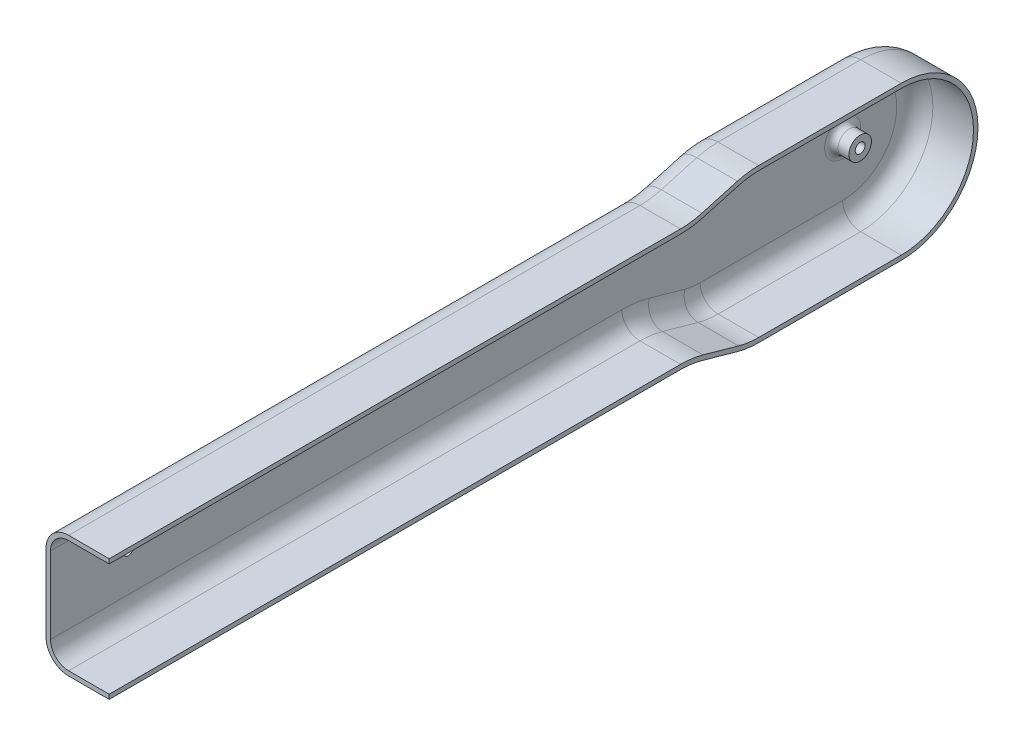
ISO-10303-21;
HEADER;
FILE_DESCRIPTION(('STEP AP214'),'2;1');
FILE_NAME('part.step','',(''),(''),'','','');
FILE_SCHEMA(('AUTOMOTIVE_DESIGN { 1 0 10303 214 1 1 1 1 }'));
ENDSEC;
DATA;
#1=APPLICATION_CONTEXT('core data for automotive mechanical design processes');
#2=APPLICATION_PROTOCOL_DEFINITION('international standard','automotive_design',2000,#1);
#3=PRODUCT_CONTEXT('',#1,'mechanical');
#4=PRODUCT('Part','Part','',(#3));
#5=PRODUCT_RELATED_PRODUCT_CATEGORY('part','',(#4));
#6=PRODUCT_DEFINITION_FORMATION('','',#4);
#7=PRODUCT_DEFINITION_CONTEXT('part definition',#1,'design');
#8=PRODUCT_DEFINITION('design','',#6,#7);
#9=PRODUCT_DEFINITION_SHAPE('','',#8);
#10=(LENGTH_UNIT() NAMED_UNIT(*) SI_UNIT(.MILLI.,.METRE.));
#11=(NAMED_UNIT(*) PLANE_ANGLE_UNIT() SI_UNIT($,.RADIAN.));
#12=(NAMED_UNIT(*) SI_UNIT($,.STERADIAN.) SOLID_ANGLE_UNIT());
#13=UNCERTAINTY_MEASURE_WITH_UNIT(LENGTH_MEASURE(1.E-05),#10,'distance_accuracy_value','');
#14=(GEOMETRIC_REPRESENTATION_CONTEXT(3) GLOBAL_UNCERTAINTY_ASSIGNED_CONTEXT((#13)) GLOBAL_UNIT_ASSIGNED_CONTEXT((#10,
#11,#12)) REPRESENTATION_CONTEXT('',''));
#15=CARTESIAN_POINT('',(0.,0.,0.));
#16=DIRECTION('',(0.,0.,1.));
#17=DIRECTION('',(1.,0.,0.));
#18=AXIS2_PLACEMENT_3D('',#15,#16,#17);
#19=CARTESIAN_POINT('',(14.,-27.,283.));
#20=DIRECTION('',(-1.,0.,0.));
#21=DIRECTION('',(0.,0.,1.));
#22=AXIS2_PLACEMENT_3D('',#19,#20,#21);
#23=PLANE('',#22);
#24=DIRECTION('',(0.,1.,0.));
#25=VECTOR('',#24,1.);
#26=CARTESIAN_POINT('',(14.,-27.,283.));
#27=LINE('',#26,#25);
#28=CARTESIAN_POINT('',(14.,25.,283.));
#29=VERTEX_POINT('',#28);
#30=CARTESIAN_POINT('',(14.,27.,283.));
#31=VERTEX_POINT('',#30);
#32=EDGE_CURVE('E538',#29,#31,#27,.T.);
#33=ORIENTED_EDGE('',*,*,#32,.F.);
#34=DIRECTION('',(0.,0.,-1.));
#35=VECTOR('',#34,1.);
#36=CARTESIAN_POINT('',(14.,25.,283.));
#37=LINE('',#36,#35);
#38=CARTESIAN_POINT('',(14.,25.,29.8075498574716));
#39=VERTEX_POINT('',#38);
#40=EDGE_CURVE('E470',#29,#39,#37,.T.);
#41=ORIENTED_EDGE('',*,*,#40,.T.);
#42=CARTESIAN_POINT('',(14.,62.,29.8075498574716));
#43=DIRECTION('',(-1.,0.,0.));
#44=DIRECTION('',(0.,0.,1.));
#45=AXIS2_PLACEMENT_3D('',#42,#43,#44);
#46=CIRCLE('',#45,37.);
#47=CARTESIAN_POINT('',(14.,26.3703312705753,19.8312426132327));
#48=VERTEX_POINT('',#47);
#49=EDGE_CURVE('E433',#48,#39,#46,.T.);
#50=ORIENTED_EDGE('',*,*,#49,.F.);
#51=DIRECTION('',(0.,-0.269629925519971,0.962964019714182));
#52=VECTOR('',#51,1.);
#53=CARTESIAN_POINT('',(14.,32.0740719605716,-0.539259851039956));
#54=LINE('',#53,#52);
#55=CARTESIAN_POINT('',(14.,30.777812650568,4.09023768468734));
#56=VERTEX_POINT('',#55);
#57=EDGE_CURVE('E477',#56,#48,#54,.T.);
#58=ORIENTED_EDGE('',*,*,#57,.F.);
#59=CARTESIAN_POINT('',(14.,-1.,-4.8075498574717));
#60=DIRECTION('',(-1.,0.,0.));
#61=DIRECTION('',(0.,0.,1.));
#62=AXIS2_PLACEMENT_3D('',#59,#60,#61);
#63=CIRCLE('',#62,33.);
#64=CARTESIAN_POINT('',(14.,32.,-4.80754985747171));
#65=VERTEX_POINT('',#64);
#66=EDGE_CURVE('E420',#65,#56,#63,.F.);
#67=ORIENTED_EDGE('',*,*,#66,.F.);
#68=DIRECTION('',(0.,0.,1.));
#69=VECTOR('',#68,1.);
#70=CARTESIAN_POINT('',(14.,32.,0.));
#71=LINE('',#70,#69);
#72=CARTESIAN_POINT('',(14.,32.,-68.));
#73=VERTEX_POINT('',#72);
#74=EDGE_CURVE('E487',#73,#65,#71,.T.);
#75=ORIENTED_EDGE('',*,*,#74,.F.);
#76=CARTESIAN_POINT('',(14.,0.,-68.));
#77=DIRECTION('',(-1.,0.,0.));
#78=DIRECTION('',(0.,0.,1.));
#79=AXIS2_PLACEMENT_3D('',#76,#77,#78);
#80=CIRCLE('',#79,32.);
#81=CARTESIAN_POINT('',(14.,-32.,-68.));
#82=VERTEX_POINT('',#81);
#83=EDGE_CURVE('E481',#82,#73,#80,.F.);
#84=ORIENTED_EDGE('',*,*,#83,.F.);
#85=DIRECTION('',(0.,0.,-1.));
#86=VECTOR('',#85,1.);
#87=CARTESIAN_POINT('',(14.,-32.,0.));
#88=LINE('',#87,#86);
#89=CARTESIAN_POINT('',(14.,-32.,-4.80754985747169));
#90=VERTEX_POINT('',#89);
#91=EDGE_CURVE('E473',#90,#82,#88,.T.);
#92=ORIENTED_EDGE('',*,*,#91,.F.);
#93=CARTESIAN_POINT('',(14.,1.,-4.8075498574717));
#94=DIRECTION('',(-1.,0.,0.));
#95=DIRECTION('',(0.,0.,1.));
#96=AXIS2_PLACEMENT_3D('',#93,#94,#95);
#97=CIRCLE('',#96,33.);
#98=CARTESIAN_POINT('',(14.,-30.777812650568,4.09023768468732));
#99=VERTEX_POINT('',#98);
#100=EDGE_CURVE('E426',#99,#90,#97,.F.);
#101=ORIENTED_EDGE('',*,*,#100,.F.);
#102=DIRECTION('',(0.,-0.269629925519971,-0.962964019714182));
#103=VECTOR('',#102,1.);
#104=CARTESIAN_POINT('',(14.,-25.0740719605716,24.4607401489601));
#105=LINE('',#104,#103);
#106=CARTESIAN_POINT('',(14.,-26.3703312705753,19.8312426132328));
#107=VERTEX_POINT('',#106);
#108=EDGE_CURVE('E397',#107,#99,#105,.T.);
#109=ORIENTED_EDGE('',*,*,#108,.F.);
#110=CARTESIAN_POINT('',(14.,-62.,29.8075498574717));
#111=DIRECTION('',(-1.,0.,0.));
#112=DIRECTION('',(0.,0.,1.));
#113=AXIS2_PLACEMENT_3D('',#110,#111,#112);
#114=CIRCLE('',#113,37.);
#115=CARTESIAN_POINT('',(14.,-25.,29.8075498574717));
#116=VERTEX_POINT('',#115);
#117=EDGE_CURVE('E332',#116,#107,#114,.T.);
#118=ORIENTED_EDGE('',*,*,#117,.F.);
#119=DIRECTION('',(0.,0.,-1.));
#120=VECTOR('',#119,1.);
#121=CARTESIAN_POINT('',(14.,-25.,283.));
#122=LINE('',#121,#120);
#123=CARTESIAN_POINT('',(14.,-25.,283.));
#124=VERTEX_POINT('',#123);
#125=EDGE_CURVE('E74',#124,#116,#122,.T.);
#126=ORIENTED_EDGE('',*,*,#125,.F.);
#127=CARTESIAN_POINT('',(14.,-27.,283.));
#128=VERTEX_POINT('',#127);
#129=EDGE_CURVE('E539',#128,#124,#27,.T.);
#130=ORIENTED_EDGE('',*,*,#129,.F.);
#131=DIRECTION('',(0.,0.,-1.));
#132=VECTOR('',#131,1.);
#133=CARTESIAN_POINT('',(14.,-27.,283.));
#134=LINE('',#133,#132);
#135=CARTESIAN_POINT('',(14.,-27.,29.8075498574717));
#136=VERTEX_POINT('',#135);
#137=EDGE_CURVE('E542',#128,#136,#134,.T.);
#138=ORIENTED_EDGE('',*,*,#137,.T.);
#139=CARTESIAN_POINT('',(14.,-62.,29.8075498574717));
#140=DIRECTION('',(-1.,0.,0.));
#141=DIRECTION('',(0.,0.,1.));
#142=AXIS2_PLACEMENT_3D('',#139,#140,#141);
#143=CIRCLE('',#142,35.);
#144=CARTESIAN_POINT('',(14.,-28.2962593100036,20.3705024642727));
#145=VERTEX_POINT('',#144);
#146=EDGE_CURVE('E584',#136,#145,#143,.T.);
#147=ORIENTED_EDGE('',*,*,#146,.T.);
#148=DIRECTION('',(0.,-0.269629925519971,-0.962964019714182));
#149=VECTOR('',#148,1.);
#150=CARTESIAN_POINT('',(14.,-27.,25.));
#151=LINE('',#150,#149);
#152=CARTESIAN_POINT('',(14.,-32.7037406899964,4.62949753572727));
#153=VERTEX_POINT('',#152);
#154=EDGE_CURVE('E498',#145,#153,#151,.T.);
#155=ORIENTED_EDGE('',*,*,#154,.T.);
#156=CARTESIAN_POINT('',(14.,1.,-4.8075498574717));
#157=DIRECTION('',(-1.,0.,0.));
#158=DIRECTION('',(0.,0.,1.));
#159=AXIS2_PLACEMENT_3D('',#156,#157,#158);
#160=CIRCLE('',#159,35.);
#161=CARTESIAN_POINT('',(14.,-34.,-4.80754985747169));
#162=VERTEX_POINT('',#161);
#163=EDGE_CURVE('E565',#153,#162,#160,.F.);
#164=ORIENTED_EDGE('',*,*,#163,.T.);
#165=DIRECTION('',(0.,0.,-1.));
#166=VECTOR('',#165,1.);
#167=CARTESIAN_POINT('',(14.,-34.,0.));
#168=LINE('',#167,#166);
#169=CARTESIAN_POINT('',(14.,-34.,-68.));
#170=VERTEX_POINT('',#169);
#171=EDGE_CURVE('E511',#162,#170,#168,.T.);
#172=ORIENTED_EDGE('',*,*,#171,.T.);
#173=CARTESIAN_POINT('',(14.,0.,-68.));
#174=DIRECTION('',(-1.,0.,0.));
#175=DIRECTION('',(0.,0.,1.));
#176=AXIS2_PLACEMENT_3D('',#173,#174,#175);
#177=CIRCLE('',#176,34.);
#178=CARTESIAN_POINT('',(14.,34.,-68.));
#179=VERTEX_POINT('',#178);
#180=EDGE_CURVE('E512',#170,#179,#177,.F.);
#181=ORIENTED_EDGE('',*,*,#180,.T.);
#182=DIRECTION('',(0.,0.,1.));
#183=VECTOR('',#182,1.);
#184=CARTESIAN_POINT('',(14.,34.,0.));
#185=LINE('',#184,#183);
#186=CARTESIAN_POINT('',(14.,34.,-4.80754985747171));
#187=VERTEX_POINT('',#186);
#188=EDGE_CURVE('E510',#179,#187,#185,.T.);
#189=ORIENTED_EDGE('',*,*,#188,.T.);
#190=CARTESIAN_POINT('',(14.,-1.,-4.8075498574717));
#191=DIRECTION('',(-1.,0.,0.));
#192=DIRECTION('',(0.,0.,1.));
#193=AXIS2_PLACEMENT_3D('',#190,#191,#192);
#194=CIRCLE('',#193,35.);
#195=CARTESIAN_POINT('',(14.,32.7037406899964,4.62949753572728));
#196=VERTEX_POINT('',#195);
#197=EDGE_CURVE('E559',#187,#196,#194,.F.);
#198=ORIENTED_EDGE('',*,*,#197,.T.);
#199=DIRECTION('',(0.,-0.269629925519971,0.962964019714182));
#200=VECTOR('',#199,1.);
#201=CARTESIAN_POINT('',(14.,34.,0.));
#202=LINE('',#201,#200);
#203=CARTESIAN_POINT('',(14.,28.2962593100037,20.3705024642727));
#204=VERTEX_POINT('',#203);
#205=EDGE_CURVE('E505',#196,#204,#202,.T.);
#206=ORIENTED_EDGE('',*,*,#205,.T.);
#207=CARTESIAN_POINT('',(14.,62.,29.8075498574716));
#208=DIRECTION('',(-1.,0.,0.));
#209=DIRECTION('',(0.,0.,1.));
#210=AXIS2_PLACEMENT_3D('',#207,#208,#209);
#211=CIRCLE('',#210,35.);
#212=CARTESIAN_POINT('',(14.,27.,29.8075498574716));
#213=VERTEX_POINT('',#212);
#214=EDGE_CURVE('E581',#204,#213,#211,.T.);
#215=ORIENTED_EDGE('',*,*,#214,.T.);
#216=DIRECTION('',(0.,0.,-1.));
#217=VECTOR('',#216,1.);
#218=CARTESIAN_POINT('',(14.,27.,283.));
#219=LINE('',#218,#217);
#220=EDGE_CURVE('E536',#31,#213,#219,.T.);
#221=ORIENTED_EDGE('',*,*,#220,.F.);
#222=EDGE_LOOP('',(#33,#41,#50,#58,#67,#75,#84,#92,#101,#109,#118,#126,#130,#138,#147,#155,#164,
#172,#181,#189,#198,#206,#215,#221));
#223=FACE_BOUND('',#222,.T.);
#224=ADVANCED_FACE('F47',(#223),#23,.F.);
#225=CARTESIAN_POINT('',(14.,27.,283.));
#226=DIRECTION('',(0.,-1.,0.));
#227=DIRECTION('',(0.,0.,-1.));
#228=AXIS2_PLACEMENT_3D('',#225,#226,#227);
#229=PLANE('',#228);
#230=DIRECTION('',(-1.,0.,0.));
#231=VECTOR('',#230,1.);
#232=CARTESIAN_POINT('',(14.,27.,29.8075498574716));
#233=LINE('',#232,#231);
#234=CARTESIAN_POINT('',(-4.,27.,29.8075498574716));
#235=VERTEX_POINT('',#234);
#236=EDGE_CURVE('E579',#213,#235,#233,.T.);
#237=ORIENTED_EDGE('',*,*,#236,.T.);
#238=DIRECTION('',(0.,0.,-1.));
#239=VECTOR('',#238,1.);
#240=CARTESIAN_POINT('',(-4.,27.,283.));
#241=LINE('',#240,#239);
#242=CARTESIAN_POINT('',(-4.,27.,283.));
#243=VERTEX_POINT('',#242);
#244=EDGE_CURVE('E659',#235,#243,#241,.F.);
#245=ORIENTED_EDGE('',*,*,#244,.T.);
#246=DIRECTION('',(-1.,0.,0.));
#247=VECTOR('',#246,1.);
#248=CARTESIAN_POINT('',(14.,27.,283.));
#249=LINE('',#248,#247);
#250=EDGE_CURVE('E524',#31,#243,#249,.T.);
#251=ORIENTED_EDGE('',*,*,#250,.F.);
#252=ORIENTED_EDGE('',*,*,#220,.T.);
#253=EDGE_LOOP('',(#237,#245,#251,#252));
#254=FACE_BOUND('',#253,.T.);
#255=ADVANCED_FACE('F719',(#254),#229,.F.);
#256=CARTESIAN_POINT('',(-14.,-27.,283.));
#257=DIRECTION('',(1.,0.,0.));
#258=DIRECTION('',(0.,0.,-1.));
#259=AXIS2_PLACEMENT_3D('',#256,#257,#258);
#260=PLANE('',#259);
#261=CARTESIAN_POINT('',(-14.,0.,-68.));
#262=DIRECTION('',(1.,0.,0.));
#263=DIRECTION('',(0.,0.,-1.));
#264=AXIS2_PLACEMENT_3D('',#261,#262,#263);
#265=CIRCLE('',#264,2.2);
#266=CARTESIAN_POINT('',(-14.,0.,-70.2));
#267=VERTEX_POINT('',#266);
#268=EDGE_CURVE('E1362',#267,#267,#265,.T.);
#269=ORIENTED_EDGE('',*,*,#268,.T.);
#270=EDGE_LOOP('',(#269));
#271=FACE_BOUND('',#270,.T.);
#272=CARTESIAN_POINT('',(-14.,0.,248.5));
#273=DIRECTION('',(-1.,0.,0.));
#274=DIRECTION('',(0.,0.,1.));
#275=AXIS2_PLACEMENT_3D('',#272,#273,#274);
#276=CIRCLE('',#275,2.1);
#277=CARTESIAN_POINT('',(-14.,0.,250.6));
#278=VERTEX_POINT('',#277);
#279=EDGE_CURVE('E313',#278,#278,#276,.T.);
#280=ORIENTED_EDGE('',*,*,#279,.F.);
#281=EDGE_LOOP('',(#280));
#282=FACE_BOUND('',#281,.T.);
#283=CARTESIAN_POINT('',(-14.,-62.,29.8075498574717));
#284=DIRECTION('',(1.,0.,0.));
#285=DIRECTION('',(0.,0.,-1.));
#286=AXIS2_PLACEMENT_3D('',#283,#284,#285);
#287=CIRCLE('',#286,45.);
#288=CARTESIAN_POINT('',(-14.,-18.6666191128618,17.674203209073));
#289=VERTEX_POINT('',#288);
#290=CARTESIAN_POINT('',(-14.,-17.,29.8075498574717));
#291=VERTEX_POINT('',#290);
#292=EDGE_CURVE('E620',#289,#291,#287,.T.);
#293=ORIENTED_EDGE('',*,*,#292,.T.);
#294=DIRECTION('',(0.,0.,-1.));
#295=VECTOR('',#294,1.);
#296=CARTESIAN_POINT('',(-14.,-17.,283.));
#297=LINE('',#296,#295);
#298=CARTESIAN_POINT('',(-14.,-17.,283.));
#299=VERTEX_POINT('',#298);
#300=EDGE_CURVE('E625',#291,#299,#297,.F.);
#301=ORIENTED_EDGE('',*,*,#300,.T.);
#302=DIRECTION('',(0.,-1.,0.));
#303=VECTOR('',#302,1.);
#304=CARTESIAN_POINT('',(-14.,-27.,283.));
#305=LINE('',#304,#303);
#306=CARTESIAN_POINT('',(-14.,17.,283.));
#307=VERTEX_POINT('',#306);
#308=EDGE_CURVE('E526',#307,#299,#305,.T.);
#309=ORIENTED_EDGE('',*,*,#308,.F.);
#310=DIRECTION('',(0.,0.,-1.));
#311=VECTOR('',#310,1.);
#312=CARTESIAN_POINT('',(-14.,17.,283.));
#313=LINE('',#312,#311);
#314=CARTESIAN_POINT('',(-14.,17.,29.8075498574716));
#315=VERTEX_POINT('',#314);
#316=EDGE_CURVE('E595',#307,#315,#313,.T.);
#317=ORIENTED_EDGE('',*,*,#316,.T.);
#318=CARTESIAN_POINT('',(-14.,62.,29.8075498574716));
#319=DIRECTION('',(1.,0.,0.));
#320=DIRECTION('',(0.,0.,-1.));
#321=AXIS2_PLACEMENT_3D('',#318,#319,#320);
#322=CIRCLE('',#321,45.);
#323=CARTESIAN_POINT('',(-14.,18.6666191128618,17.674203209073));
#324=VERTEX_POINT('',#323);
#325=EDGE_CURVE('E593',#315,#324,#322,.T.);
#326=ORIENTED_EDGE('',*,*,#325,.T.);
#327=DIRECTION('',(0.,0.269629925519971,-0.962964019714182));
#328=VECTOR('',#327,1.);
#329=CARTESIAN_POINT('',(-14.,23.0741004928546,1.93319828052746));
#330=LINE('',#329,#328);
#331=CARTESIAN_POINT('',(-14.,23.0741004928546,1.93319828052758));
#332=VERTEX_POINT('',#331);
#333=EDGE_CURVE('E596',#324,#332,#330,.T.);
#334=ORIENTED_EDGE('',*,*,#333,.T.);
#335=CARTESIAN_POINT('',(-14.,-1.,-4.8075498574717));
#336=DIRECTION('',(1.,0.,0.));
#337=DIRECTION('',(0.,0.,-1.));
#338=AXIS2_PLACEMENT_3D('',#335,#336,#337);
#339=CIRCLE('',#338,25.);
#340=CARTESIAN_POINT('',(-14.,24.,-4.8075498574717));
#341=VERTEX_POINT('',#340);
#342=EDGE_CURVE('E603',#332,#341,#339,.F.);
#343=ORIENTED_EDGE('',*,*,#342,.T.);
#344=DIRECTION('',(0.,0.,-1.));
#345=VECTOR('',#344,1.);
#346=CARTESIAN_POINT('',(-14.,24.,-68.));
#347=LINE('',#346,#345);
#348=CARTESIAN_POINT('',(-14.,24.,-68.));
#349=VERTEX_POINT('',#348);
#350=EDGE_CURVE('E605',#341,#349,#347,.T.);
#351=ORIENTED_EDGE('',*,*,#350,.T.);
#352=CARTESIAN_POINT('',(-14.,0.,-68.));
#353=DIRECTION('',(1.,0.,0.));
#354=DIRECTION('',(0.,0.,-1.));
#355=AXIS2_PLACEMENT_3D('',#352,#353,#354);
#356=CIRCLE('',#355,24.);
#357=CARTESIAN_POINT('',(-14.,-24.,-68.));
#358=VERTEX_POINT('',#357);
#359=EDGE_CURVE('E610',#349,#358,#356,.F.);
#360=ORIENTED_EDGE('',*,*,#359,.T.);
#361=DIRECTION('',(0.,0.,1.));
#362=VECTOR('',#361,1.);
#363=CARTESIAN_POINT('',(-14.,-24.,-4.80754985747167));
#364=LINE('',#363,#362);
#365=CARTESIAN_POINT('',(-14.,-24.,-4.80754985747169));
#366=VERTEX_POINT('',#365);
#367=EDGE_CURVE('E609',#358,#366,#364,.T.);
#368=ORIENTED_EDGE('',*,*,#367,.T.);
#369=CARTESIAN_POINT('',(-14.,1.,-4.8075498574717));
#370=DIRECTION('',(1.,0.,0.));
#371=DIRECTION('',(0.,0.,-1.));
#372=AXIS2_PLACEMENT_3D('',#369,#370,#371);
#373=CIRCLE('',#372,25.);
#374=CARTESIAN_POINT('',(-14.,-23.0741004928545,1.93319828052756));
#375=VERTEX_POINT('',#374);
#376=EDGE_CURVE('E614',#366,#375,#373,.F.);
#377=ORIENTED_EDGE('',*,*,#376,.T.);
#378=DIRECTION('',(0.,0.269629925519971,0.962964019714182));
#379=VECTOR('',#378,1.);
#380=CARTESIAN_POINT('',(-14.,-18.6666191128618,17.674203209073));
#381=LINE('',#380,#379);
#382=EDGE_CURVE('E618',#375,#289,#381,.T.);
#383=ORIENTED_EDGE('',*,*,#382,.T.);
#384=EDGE_LOOP('',(#293,#301,#309,#317,#326,#334,#343,#351,#360,#368,#377,#383));
#385=FACE_BOUND('',#384,.T.);
#386=ADVANCED_FACE('F726',(#271,#282,#385),#260,.F.);
#387=CARTESIAN_POINT('',(14.,-27.,283.));
#388=DIRECTION('',(0.,1.,0.));
#389=DIRECTION('',(0.,0.,1.));
#390=AXIS2_PLACEMENT_3D('',#387,#388,#389);
#391=PLANE('',#390);
#392=DIRECTION('',(1.,0.,0.));
#393=VECTOR('',#392,1.);
#394=CARTESIAN_POINT('',(14.,-27.,283.));
#395=LINE('',#394,#393);
#396=CARTESIAN_POINT('',(-4.,-27.,283.));
#397=VERTEX_POINT('',#396);
#398=EDGE_CURVE('E531',#397,#128,#395,.T.);
#399=ORIENTED_EDGE('',*,*,#398,.F.);
#400=DIRECTION('',(0.,0.,-1.));
#401=VECTOR('',#400,1.);
#402=CARTESIAN_POINT('',(-4.,-27.,283.));
#403=LINE('',#402,#401);
#404=CARTESIAN_POINT('',(-4.,-27.,29.8075498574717));
#405=VERTEX_POINT('',#404);
#406=EDGE_CURVE('E588',#397,#405,#403,.T.);
#407=ORIENTED_EDGE('',*,*,#406,.T.);
#408=DIRECTION('',(-1.,0.,0.));
#409=VECTOR('',#408,1.);
#410=CARTESIAN_POINT('',(14.,-27.,29.8075498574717));
#411=LINE('',#410,#409);
#412=EDGE_CURVE('E564',#405,#136,#411,.F.);
#413=ORIENTED_EDGE('',*,*,#412,.T.);
#414=ORIENTED_EDGE('',*,*,#137,.F.);
#415=EDGE_LOOP('',(#399,#407,#413,#414));
#416=FACE_BOUND('',#415,.T.);
#417=ADVANCED_FACE('F731',(#416),#391,.F.);
#418=CARTESIAN_POINT('',(0.,0.,283.));
#419=DIRECTION('',(0.,0.,-1.));
#420=DIRECTION('',(-1.,0.,0.));
#421=AXIS2_PLACEMENT_3D('',#418,#419,#420);
#422=PLANE('',#421);
#423=CARTESIAN_POINT('',(-4.,17.,283.));
#424=DIRECTION('',(0.,0.,-1.));
#425=DIRECTION('',(-1.,0.,0.));
#426=AXIS2_PLACEMENT_3D('',#423,#424,#425);
#427=CIRCLE('',#426,8.);
#428=CARTESIAN_POINT('',(-12.,17.,283.));
#429=VERTEX_POINT('',#428);
#430=CARTESIAN_POINT('',(-4.,25.,283.));
#431=VERTEX_POINT('',#430);
#432=EDGE_CURVE('E302',#429,#431,#427,.T.);
#433=ORIENTED_EDGE('',*,*,#432,.T.);
#434=DIRECTION('',(1.,0.,0.));
#435=VECTOR('',#434,1.);
#436=CARTESIAN_POINT('',(-4.,25.,283.));
#437=LINE('',#436,#435);
#438=EDGE_CURVE('E323',#431,#29,#437,.T.);
#439=ORIENTED_EDGE('',*,*,#438,.T.);
#440=ORIENTED_EDGE('',*,*,#32,.T.);
#441=ORIENTED_EDGE('',*,*,#250,.T.);
#442=CARTESIAN_POINT('',(-4.,17.,283.));
#443=DIRECTION('',(0.,0.,-1.));
#444=DIRECTION('',(-1.,0.,0.));
#445=AXIS2_PLACEMENT_3D('',#442,#443,#444);
#446=CIRCLE('',#445,10.);
#447=EDGE_CURVE('E622',#243,#307,#446,.F.);
#448=ORIENTED_EDGE('',*,*,#447,.T.);
#449=ORIENTED_EDGE('',*,*,#308,.T.);
#450=CARTESIAN_POINT('',(-4.,-17.,283.));
#451=DIRECTION('',(0.,0.,-1.));
#452=DIRECTION('',(-1.,0.,0.));
#453=AXIS2_PLACEMENT_3D('',#450,#451,#452);
#454=CIRCLE('',#453,10.);
#455=EDGE_CURVE('E628',#299,#397,#454,.F.);
#456=ORIENTED_EDGE('',*,*,#455,.T.);
#457=ORIENTED_EDGE('',*,*,#398,.T.);
#458=ORIENTED_EDGE('',*,*,#129,.T.);
#459=DIRECTION('',(-1.,0.,0.));
#460=VECTOR('',#459,1.);
#461=CARTESIAN_POINT('',(14.,-25.,283.));
#462=LINE('',#461,#460);
#463=CARTESIAN_POINT('',(-4.,-25.,283.));
#464=VERTEX_POINT('',#463);
#465=EDGE_CURVE('E308',#124,#464,#462,.T.);
#466=ORIENTED_EDGE('',*,*,#465,.T.);
#467=CARTESIAN_POINT('',(-4.,-17.,283.));
#468=DIRECTION('',(0.,0.,-1.));
#469=DIRECTION('',(-1.,0.,0.));
#470=AXIS2_PLACEMENT_3D('',#467,#468,#469);
#471=CIRCLE('',#470,8.);
#472=CARTESIAN_POINT('',(-12.,-17.,283.));
#473=VERTEX_POINT('',#472);
#474=EDGE_CURVE('E288',#464,#473,#471,.T.);
#475=ORIENTED_EDGE('',*,*,#474,.T.);
#476=DIRECTION('',(0.,1.,0.));
#477=VECTOR('',#476,1.);
#478=CARTESIAN_POINT('',(-12.,-17.,283.));
#479=LINE('',#478,#477);
#480=EDGE_CURVE('E299',#473,#429,#479,.T.);
#481=ORIENTED_EDGE('',*,*,#480,.T.);
#482=EDGE_LOOP('',(#433,#439,#440,#441,#448,#449,#456,#457,#458,#466,#475,#481));
#483=FACE_BOUND('',#482,.T.);
#484=ADVANCED_FACE('F306',(#483),#422,.F.);
#485=CARTESIAN_POINT('',(158.059015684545,0.,-68.));
#486=DIRECTION('',(-1.,0.,0.));
#487=DIRECTION('',(0.,0.,1.));
#488=AXIS2_PLACEMENT_3D('',#485,#486,#487);
#489=CYLINDRICAL_SURFACE('',#488,34.);
#490=DIRECTION('',(-1.,0.,0.));
#491=VECTOR('',#490,1.);
#492=CARTESIAN_POINT('',(158.059015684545,-34.,-68.));
#493=LINE('',#492,#491);
#494=CARTESIAN_POINT('',(-4.,-34.,-68.));
#495=VERTEX_POINT('',#494);
#496=EDGE_CURVE('E517',#170,#495,#493,.T.);
#497=ORIENTED_EDGE('',*,*,#496,.T.);
#498=CARTESIAN_POINT('',(-4.,0.,-68.));
#499=DIRECTION('',(1.,0.,0.));
#500=DIRECTION('',(0.,0.,-1.));
#501=AXIS2_PLACEMENT_3D('',#498,#499,#500);
#502=CIRCLE('',#501,34.);
#503=CARTESIAN_POINT('',(-4.,34.,-68.));
#504=VERTEX_POINT('',#503);
#505=EDGE_CURVE('E644',#495,#504,#502,.T.);
#506=ORIENTED_EDGE('',*,*,#505,.T.);
#507=DIRECTION('',(-1.,0.,0.));
#508=VECTOR('',#507,1.);
#509=CARTESIAN_POINT('',(158.059015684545,34.,-68.));
#510=LINE('',#509,#508);
#511=EDGE_CURVE('E503',#179,#504,#510,.T.);
#512=ORIENTED_EDGE('',*,*,#511,.F.);
#513=ORIENTED_EDGE('',*,*,#180,.F.);
#514=EDGE_LOOP('',(#497,#506,#512,#513));
#515=FACE_BOUND('',#514,.T.);
#516=ADVANCED_FACE('F841',(#515),#489,.T.);
#517=CARTESIAN_POINT('',(158.059015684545,34.,0.));
#518=DIRECTION('',(0.,1.,0.));
#519=DIRECTION('',(0.,0.,1.));
#520=AXIS2_PLACEMENT_3D('',#517,#518,#519);
#521=PLANE('',#520);
#522=ORIENTED_EDGE('',*,*,#511,.T.);
#523=DIRECTION('',(0.,0.,-1.));
#524=VECTOR('',#523,1.);
#525=CARTESIAN_POINT('',(-4.,34.,-4.80754985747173));
#526=LINE('',#525,#524);
#527=CARTESIAN_POINT('',(-4.,34.,-4.80754985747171));
#528=VERTEX_POINT('',#527);
#529=EDGE_CURVE('E648',#504,#528,#526,.F.);
#530=ORIENTED_EDGE('',*,*,#529,.T.);
#531=DIRECTION('',(-1.,0.,0.));
#532=VECTOR('',#531,1.);
#533=CARTESIAN_POINT('',(158.059015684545,34.,-4.80754985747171));
#534=LINE('',#533,#532);
#535=EDGE_CURVE('E574',#528,#187,#534,.F.);
#536=ORIENTED_EDGE('',*,*,#535,.T.);
#537=ORIENTED_EDGE('',*,*,#188,.F.);
#538=EDGE_LOOP('',(#522,#530,#536,#537));
#539=FACE_BOUND('',#538,.T.);
#540=ADVANCED_FACE('F854',(#539),#521,.T.);
#541=CARTESIAN_POINT('',(158.059015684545,34.,0.));
#542=DIRECTION('',(0.,0.962964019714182,0.269629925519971));
#543=DIRECTION('',(0.,-0.269629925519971,0.962964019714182));
#544=AXIS2_PLACEMENT_3D('',#541,#542,#543);
#545=PLANE('',#544);
#546=DIRECTION('',(-1.,0.,0.));
#547=VECTOR('',#546,1.);
#548=CARTESIAN_POINT('',(158.059015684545,32.7037406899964,4.62949753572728));
#549=LINE('',#548,#547);
#550=CARTESIAN_POINT('',(-4.,32.7037406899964,4.62949753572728));
#551=VERTEX_POINT('',#550);
#552=EDGE_CURVE('E571',#196,#551,#549,.T.);
#553=ORIENTED_EDGE('',*,*,#552,.T.);
#554=DIRECTION('',(0.,0.269629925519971,-0.962964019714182));
#555=VECTOR('',#554,1.);
#556=CARTESIAN_POINT('',(-4.,28.2962593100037,20.3705024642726));
#557=LINE('',#556,#555);
#558=CARTESIAN_POINT('',(-4.,28.2962593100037,20.3705024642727));
#559=VERTEX_POINT('',#558);
#560=EDGE_CURVE('E655',#551,#559,#557,.F.);
#561=ORIENTED_EDGE('',*,*,#560,.T.);
#562=DIRECTION('',(-1.,0.,0.));
#563=VECTOR('',#562,1.);
#564=CARTESIAN_POINT('',(158.059015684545,28.2962593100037,20.3705024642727));
#565=LINE('',#564,#563);
#566=EDGE_CURVE('E568',#559,#204,#565,.F.);
#567=ORIENTED_EDGE('',*,*,#566,.T.);
#568=ORIENTED_EDGE('',*,*,#205,.F.);
#569=EDGE_LOOP('',(#553,#561,#567,#568));
#570=FACE_BOUND('',#569,.T.);
#571=ADVANCED_FACE('F861',(#570),#545,.T.);
#572=CARTESIAN_POINT('',(158.059015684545,-27.,25.));
#573=DIRECTION('',(0.,-0.962964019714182,0.269629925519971));
#574=DIRECTION('',(0.,-0.269629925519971,-0.962964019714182));
#575=AXIS2_PLACEMENT_3D('',#572,#573,#574);
#576=PLANE('',#575);
#577=DIRECTION('',(-1.,0.,0.));
#578=VECTOR('',#577,1.);
#579=CARTESIAN_POINT('',(158.059015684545,-28.2962593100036,20.3705024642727));
#580=LINE('',#579,#578);
#581=CARTESIAN_POINT('',(-4.,-28.2962593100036,20.3705024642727));
#582=VERTEX_POINT('',#581);
#583=EDGE_CURVE('E552',#145,#582,#580,.T.);
#584=ORIENTED_EDGE('',*,*,#583,.T.);
#585=DIRECTION('',(0.,0.269629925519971,0.962964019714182));
#586=VECTOR('',#585,1.);
#587=CARTESIAN_POINT('',(-4.,-32.7037406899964,4.62949753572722));
#588=LINE('',#587,#586);
#589=CARTESIAN_POINT('',(-4.,-32.7037406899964,4.62949753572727));
#590=VERTEX_POINT('',#589);
#591=EDGE_CURVE('E632',#582,#590,#588,.F.);
#592=ORIENTED_EDGE('',*,*,#591,.T.);
#593=DIRECTION('',(-1.,0.,0.));
#594=VECTOR('',#593,1.);
#595=CARTESIAN_POINT('',(158.059015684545,-32.7037406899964,4.62949753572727));
#596=LINE('',#595,#594);
#597=EDGE_CURVE('E558',#590,#153,#596,.F.);
#598=ORIENTED_EDGE('',*,*,#597,.T.);
#599=ORIENTED_EDGE('',*,*,#154,.F.);
#600=EDGE_LOOP('',(#584,#592,#598,#599));
#601=FACE_BOUND('',#600,.T.);
#602=ADVANCED_FACE('F826',(#601),#576,.T.);
#603=CARTESIAN_POINT('',(158.059015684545,-34.,0.));
#604=DIRECTION('',(0.,-1.,0.));
#605=DIRECTION('',(0.,0.,-1.));
#606=AXIS2_PLACEMENT_3D('',#603,#604,#605);
#607=PLANE('',#606);
#608=DIRECTION('',(-1.,0.,0.));
#609=VECTOR('',#608,1.);
#610=CARTESIAN_POINT('',(158.059015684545,-34.,-4.80754985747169));
#611=LINE('',#610,#609);
#612=CARTESIAN_POINT('',(-4.,-34.,-4.80754985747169));
#613=VERTEX_POINT('',#612);
#614=EDGE_CURVE('E549',#162,#613,#611,.T.);
#615=ORIENTED_EDGE('',*,*,#614,.T.);
#616=DIRECTION('',(0.,0.,1.));
#617=VECTOR('',#616,1.);
#618=CARTESIAN_POINT('',(-4.,-34.,-68.));
#619=LINE('',#618,#617);
#620=EDGE_CURVE('E639',#613,#495,#619,.F.);
#621=ORIENTED_EDGE('',*,*,#620,.T.);
#622=ORIENTED_EDGE('',*,*,#496,.F.);
#623=ORIENTED_EDGE('',*,*,#171,.F.);
#624=EDGE_LOOP('',(#615,#621,#622,#623));
#625=FACE_BOUND('',#624,.T.);
#626=ADVANCED_FACE('F743',(#625),#607,.T.);
#627=CARTESIAN_POINT('',(158.059015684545,1.,-4.8075498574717));
#628=DIRECTION('',(-1.,0.,0.));
#629=DIRECTION('',(0.,0.,1.));
#630=AXIS2_PLACEMENT_3D('',#627,#628,#629);
#631=CYLINDRICAL_SURFACE('',#630,35.);
#632=ORIENTED_EDGE('',*,*,#597,.F.);
#633=CARTESIAN_POINT('',(-4.,1.,-4.8075498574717));
#634=DIRECTION('',(1.,0.,0.));
#635=DIRECTION('',(0.,0.,-1.));
#636=AXIS2_PLACEMENT_3D('',#633,#634,#635);
#637=CIRCLE('',#636,35.);
#638=EDGE_CURVE('E640',#590,#613,#637,.T.);
#639=ORIENTED_EDGE('',*,*,#638,.T.);
#640=ORIENTED_EDGE('',*,*,#614,.F.);
#641=ORIENTED_EDGE('',*,*,#163,.F.);
#642=EDGE_LOOP('',(#632,#639,#640,#641));
#643=FACE_BOUND('',#642,.T.);
#644=ADVANCED_FACE('F742',(#643),#631,.T.);
#645=CARTESIAN_POINT('',(158.059015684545,-62.,29.8075498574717));
#646=DIRECTION('',(-1.,0.,0.));
#647=DIRECTION('',(0.,0.,1.));
#648=AXIS2_PLACEMENT_3D('',#645,#646,#647);
#649=CYLINDRICAL_SURFACE('',#648,35.);
#650=ORIENTED_EDGE('',*,*,#412,.F.);
#651=CARTESIAN_POINT('',(-4.,-62.,29.8075498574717));
#652=DIRECTION('',(1.,0.,0.));
#653=DIRECTION('',(0.,0.,-1.));
#654=AXIS2_PLACEMENT_3D('',#651,#652,#653);
#655=CIRCLE('',#654,35.);
#656=EDGE_CURVE('E631',#405,#582,#655,.F.);
#657=ORIENTED_EDGE('',*,*,#656,.T.);
#658=ORIENTED_EDGE('',*,*,#583,.F.);
#659=ORIENTED_EDGE('',*,*,#146,.F.);
#660=EDGE_LOOP('',(#650,#657,#658,#659));
#661=FACE_BOUND('',#660,.T.);
#662=ADVANCED_FACE('F741',(#661),#649,.F.);
#663=CARTESIAN_POINT('',(158.059015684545,-1.,-4.8075498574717));
#664=DIRECTION('',(-1.,0.,0.));
#665=DIRECTION('',(0.,0.,1.));
#666=AXIS2_PLACEMENT_3D('',#663,#664,#665);
#667=CYLINDRICAL_SURFACE('',#666,35.);
#668=ORIENTED_EDGE('',*,*,#535,.F.);
#669=CARTESIAN_POINT('',(-4.,-1.,-4.8075498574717));
#670=DIRECTION('',(1.,0.,0.));
#671=DIRECTION('',(0.,0.,-1.));
#672=AXIS2_PLACEMENT_3D('',#669,#670,#671);
#673=CIRCLE('',#672,35.);
#674=EDGE_CURVE('E650',#528,#551,#673,.T.);
#675=ORIENTED_EDGE('',*,*,#674,.T.);
#676=ORIENTED_EDGE('',*,*,#552,.F.);
#677=ORIENTED_EDGE('',*,*,#197,.F.);
#678=EDGE_LOOP('',(#668,#675,#676,#677));
#679=FACE_BOUND('',#678,.T.);
#680=ADVANCED_FACE('F750',(#679),#667,.T.);
#681=CARTESIAN_POINT('',(14.,62.,29.8075498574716));
#682=DIRECTION('',(-1.,0.,0.));
#683=DIRECTION('',(0.,0.,1.));
#684=AXIS2_PLACEMENT_3D('',#681,#682,#683);
#685=CYLINDRICAL_SURFACE('',#684,35.);
#686=ORIENTED_EDGE('',*,*,#566,.F.);
#687=CARTESIAN_POINT('',(-4.,62.,29.8075498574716));
#688=DIRECTION('',(1.,0.,0.));
#689=DIRECTION('',(0.,0.,-1.));
#690=AXIS2_PLACEMENT_3D('',#687,#688,#689);
#691=CIRCLE('',#690,35.);
#692=EDGE_CURVE('E654',#559,#235,#691,.F.);
#693=ORIENTED_EDGE('',*,*,#692,.T.);
#694=ORIENTED_EDGE('',*,*,#236,.F.);
#695=ORIENTED_EDGE('',*,*,#214,.F.);
#696=EDGE_LOOP('',(#686,#693,#694,#695));
#697=FACE_BOUND('',#696,.T.);
#698=ADVANCED_FACE('F751',(#697),#685,.F.);
#699=CARTESIAN_POINT('',(-4.,17.,283.));
#700=DIRECTION('',(0.,0.,-1.));
#701=DIRECTION('',(-1.,0.,0.));
#702=AXIS2_PLACEMENT_3D('',#699,#700,#701);
#703=CYLINDRICAL_SURFACE('',#702,10.);
#704=ORIENTED_EDGE('',*,*,#447,.F.);
#705=ORIENTED_EDGE('',*,*,#244,.F.);
#706=CARTESIAN_POINT('',(-4.,17.,29.8075498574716));
#707=DIRECTION('',(0.,0.,-1.));
#708=DIRECTION('',(-1.,0.,0.));
#709=AXIS2_PLACEMENT_3D('',#706,#707,#708);
#710=CIRCLE('',#709,10.);
#711=EDGE_CURVE('E525',#315,#235,#710,.T.);
#712=ORIENTED_EDGE('',*,*,#711,.F.);
#713=ORIENTED_EDGE('',*,*,#316,.F.);
#714=EDGE_LOOP('',(#704,#705,#712,#713));
#715=FACE_BOUND('',#714,.T.);
#716=ADVANCED_FACE('F760',(#715),#703,.T.);
#717=CARTESIAN_POINT('',(-4.,62.,29.8075498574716));
#718=DIRECTION('',(1.,0.,0.));
#719=DIRECTION('',(0.,0.,-1.));
#720=AXIS2_PLACEMENT_3D('',#717,#718,#719);
#721=TOROIDAL_SURFACE('',#720,45.,10.);
#722=ORIENTED_EDGE('',*,*,#711,.T.);
#723=ORIENTED_EDGE('',*,*,#692,.F.);
#724=CARTESIAN_POINT('',(-4.,18.6666191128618,17.674203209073));
#725=DIRECTION('',(0.,0.269629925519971,-0.962964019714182));
#726=DIRECTION('',(0.,0.962964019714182,0.269629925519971));
#727=AXIS2_PLACEMENT_3D('',#724,#725,#726);
#728=CIRCLE('',#727,10.);
#729=EDGE_CURVE('E691',#324,#559,#728,.T.);
#730=ORIENTED_EDGE('',*,*,#729,.F.);
#731=ORIENTED_EDGE('',*,*,#325,.F.);
#732=EDGE_LOOP('',(#722,#723,#730,#731));
#733=FACE_BOUND('',#732,.T.);
#734=ADVANCED_FACE('F793',(#733),#721,.T.);
#735=CARTESIAN_POINT('',(-4.,-53.5435867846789,275.56779570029));
#736=DIRECTION('',(0.,-0.269629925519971,0.962964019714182));
#737=DIRECTION('',(0.,-0.962964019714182,-0.269629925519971));
#738=AXIS2_PLACEMENT_3D('',#735,#736,#737);
#739=CYLINDRICAL_SURFACE('',#738,10.);
#740=ORIENTED_EDGE('',*,*,#729,.T.);
#741=ORIENTED_EDGE('',*,*,#560,.F.);
#742=CARTESIAN_POINT('',(-4.,23.0741004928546,1.93319828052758));
#743=DIRECTION('',(0.,0.269629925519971,-0.962964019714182));
#744=DIRECTION('',(0.,0.962964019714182,0.269629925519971));
#745=AXIS2_PLACEMENT_3D('',#742,#743,#744);
#746=CIRCLE('',#745,10.);
#747=EDGE_CURVE('E690',#332,#551,#746,.T.);
#748=ORIENTED_EDGE('',*,*,#747,.F.);
#749=ORIENTED_EDGE('',*,*,#333,.F.);
#750=EDGE_LOOP('',(#740,#741,#748,#749));
#751=FACE_BOUND('',#750,.T.);
#752=ADVANCED_FACE('F792',(#751),#739,.T.);
#753=CARTESIAN_POINT('',(-4.,-1.,-4.8075498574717));
#754=DIRECTION('',(1.,0.,0.));
#755=DIRECTION('',(0.,0.,-1.));
#756=AXIS2_PLACEMENT_3D('',#753,#754,#755);
#757=TOROIDAL_SURFACE('',#756,25.,10.);
#758=ORIENTED_EDGE('',*,*,#747,.T.);
#759=ORIENTED_EDGE('',*,*,#674,.F.);
#760=CARTESIAN_POINT('',(-4.,24.,-4.8075498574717));
#761=DIRECTION('',(0.,0.,-1.));
#762=DIRECTION('',(0.,1.,0.));
#763=AXIS2_PLACEMENT_3D('',#760,#761,#762);
#764=CIRCLE('',#763,10.);
#765=EDGE_CURVE('E681',#341,#528,#764,.T.);
#766=ORIENTED_EDGE('',*,*,#765,.F.);
#767=ORIENTED_EDGE('',*,*,#342,.F.);
#768=EDGE_LOOP('',(#758,#759,#766,#767));
#769=FACE_BOUND('',#768,.T.);
#770=ADVANCED_FACE('F790',(#769),#757,.T.);
#771=CARTESIAN_POINT('',(-4.,24.0000000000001,283.));
#772=DIRECTION('',(0.,0.,1.));
#773=DIRECTION('',(0.,-1.,0.));
#774=AXIS2_PLACEMENT_3D('',#771,#772,#773);
#775=CYLINDRICAL_SURFACE('',#774,10.);
#776=ORIENTED_EDGE('',*,*,#765,.T.);
#777=ORIENTED_EDGE('',*,*,#529,.F.);
#778=CARTESIAN_POINT('',(-4.,24.,-68.));
#779=DIRECTION('',(0.,0.,-1.));
#780=DIRECTION('',(-1.,0.,0.));
#781=AXIS2_PLACEMENT_3D('',#778,#779,#780);
#782=CIRCLE('',#781,10.);
#783=EDGE_CURVE('E676',#349,#504,#782,.T.);
#784=ORIENTED_EDGE('',*,*,#783,.F.);
#785=ORIENTED_EDGE('',*,*,#350,.F.);
#786=EDGE_LOOP('',(#776,#777,#784,#785));
#787=FACE_BOUND('',#786,.T.);
#788=ADVANCED_FACE('F783',(#787),#775,.T.);
#789=CARTESIAN_POINT('',(-4.,0.,-68.));
#790=DIRECTION('',(1.,0.,0.));
#791=DIRECTION('',(0.,0.,-1.));
#792=AXIS2_PLACEMENT_3D('',#789,#790,#791);
#793=TOROIDAL_SURFACE('',#792,24.,10.);
#794=ORIENTED_EDGE('',*,*,#783,.T.);
#795=ORIENTED_EDGE('',*,*,#505,.F.);
#796=CARTESIAN_POINT('',(-4.,-24.,-68.));
#797=DIRECTION('',(0.,0.,1.));
#798=DIRECTION('',(1.,0.,0.));
#799=AXIS2_PLACEMENT_3D('',#796,#797,#798);
#800=CIRCLE('',#799,10.);
#801=EDGE_CURVE('E674',#358,#495,#800,.T.);
#802=ORIENTED_EDGE('',*,*,#801,.F.);
#803=ORIENTED_EDGE('',*,*,#359,.F.);
#804=EDGE_LOOP('',(#794,#795,#802,#803));
#805=FACE_BOUND('',#804,.T.);
#806=ADVANCED_FACE('F780',(#805),#793,.T.);
#807=CARTESIAN_POINT('',(-4.,-23.9999999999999,283.));
#808=DIRECTION('',(0.,0.,-1.));
#809=DIRECTION('',(0.,1.,0.));
#810=AXIS2_PLACEMENT_3D('',#807,#808,#809);
#811=CYLINDRICAL_SURFACE('',#810,10.);
#812=ORIENTED_EDGE('',*,*,#801,.T.);
#813=ORIENTED_EDGE('',*,*,#620,.F.);
#814=CARTESIAN_POINT('',(-4.,-24.,-4.80754985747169));
#815=DIRECTION('',(0.,0.,1.));
#816=DIRECTION('',(0.,-1.,0.));
#817=AXIS2_PLACEMENT_3D('',#814,#815,#816);
#818=CIRCLE('',#817,10.);
#819=EDGE_CURVE('E671',#366,#613,#818,.T.);
#820=ORIENTED_EDGE('',*,*,#819,.F.);
#821=ORIENTED_EDGE('',*,*,#367,.F.);
#822=EDGE_LOOP('',(#812,#813,#820,#821));
#823=FACE_BOUND('',#822,.T.);
#824=ADVANCED_FACE('F773',(#823),#811,.T.);
#825=CARTESIAN_POINT('',(-4.,1.,-4.8075498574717));
#826=DIRECTION('',(1.,0.,0.));
#827=DIRECTION('',(0.,0.,-1.));
#828=AXIS2_PLACEMENT_3D('',#825,#826,#827);
#829=TOROIDAL_SURFACE('',#828,25.,10.);
#830=ORIENTED_EDGE('',*,*,#819,.T.);
#831=ORIENTED_EDGE('',*,*,#638,.F.);
#832=CARTESIAN_POINT('',(-4.,-23.0741004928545,1.93319828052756));
#833=DIRECTION('',(0.,0.269629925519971,0.962964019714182));
#834=DIRECTION('',(0.,-0.962964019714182,0.269629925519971));
#835=AXIS2_PLACEMENT_3D('',#832,#833,#834);
#836=CIRCLE('',#835,10.);
#837=EDGE_CURVE('E669',#375,#590,#836,.T.);
#838=ORIENTED_EDGE('',*,*,#837,.F.);
#839=ORIENTED_EDGE('',*,*,#376,.F.);
#840=EDGE_LOOP('',(#830,#831,#838,#839));
#841=FACE_BOUND('',#840,.T.);
#842=ADVANCED_FACE('F772',(#841),#829,.T.);
#843=CARTESIAN_POINT('',(-4.,49.6177707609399,261.547024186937));
#844=DIRECTION('',(0.,-0.269629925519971,-0.962964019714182));
#845=DIRECTION('',(0.,0.962964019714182,-0.269629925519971));
#846=AXIS2_PLACEMENT_3D('',#843,#844,#845);
#847=CYLINDRICAL_SURFACE('',#846,10.);
#848=ORIENTED_EDGE('',*,*,#837,.T.);
#849=ORIENTED_EDGE('',*,*,#591,.F.);
#850=CARTESIAN_POINT('',(-4.,-18.6666191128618,17.674203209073));
#851=DIRECTION('',(0.,0.269629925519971,0.962964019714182));
#852=DIRECTION('',(0.,-0.962964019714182,0.269629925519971));
#853=AXIS2_PLACEMENT_3D('',#850,#851,#852);
#854=CIRCLE('',#853,10.);
#855=EDGE_CURVE('E661',#289,#582,#854,.T.);
#856=ORIENTED_EDGE('',*,*,#855,.F.);
#857=ORIENTED_EDGE('',*,*,#382,.F.);
#858=EDGE_LOOP('',(#848,#849,#856,#857));
#859=FACE_BOUND('',#858,.T.);
#860=ADVANCED_FACE('F770',(#859),#847,.T.);
#861=CARTESIAN_POINT('',(-4.,-62.,29.8075498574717));
#862=DIRECTION('',(1.,0.,0.));
#863=DIRECTION('',(0.,0.,-1.));
#864=AXIS2_PLACEMENT_3D('',#861,#862,#863);
#865=TOROIDAL_SURFACE('',#864,45.,10.);
#866=ORIENTED_EDGE('',*,*,#855,.T.);
#867=ORIENTED_EDGE('',*,*,#656,.F.);
#868=CARTESIAN_POINT('',(-4.,-17.,29.8075498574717));
#869=DIRECTION('',(0.,0.,1.));
#870=DIRECTION('',(1.,0.,0.));
#871=AXIS2_PLACEMENT_3D('',#868,#869,#870);
#872=CIRCLE('',#871,10.);
#873=EDGE_CURVE('E337',#291,#405,#872,.T.);
#874=ORIENTED_EDGE('',*,*,#873,.F.);
#875=ORIENTED_EDGE('',*,*,#292,.F.);
#876=EDGE_LOOP('',(#866,#867,#874,#875));
#877=FACE_BOUND('',#876,.T.);
#878=ADVANCED_FACE('F763',(#877),#865,.T.);
#879=CARTESIAN_POINT('',(-4.,-17.,283.));
#880=DIRECTION('',(0.,0.,-1.));
#881=DIRECTION('',(-1.,0.,0.));
#882=AXIS2_PLACEMENT_3D('',#879,#880,#881);
#883=CYLINDRICAL_SURFACE('',#882,10.);
#884=ORIENTED_EDGE('',*,*,#455,.F.);
#885=ORIENTED_EDGE('',*,*,#300,.F.);
#886=ORIENTED_EDGE('',*,*,#873,.T.);
#887=ORIENTED_EDGE('',*,*,#406,.F.);
#888=EDGE_LOOP('',(#884,#885,#886,#887));
#889=FACE_BOUND('',#888,.T.);
#890=ADVANCED_FACE('F757',(#889),#883,.T.);
#891=CARTESIAN_POINT('',(14.,25.,283.));
#892=DIRECTION('',(0.,-1.,0.));
#893=DIRECTION('',(0.,0.,-1.));
#894=AXIS2_PLACEMENT_3D('',#891,#892,#893);
#895=PLANE('',#894);
#896=DIRECTION('',(1.,0.,0.));
#897=VECTOR('',#896,1.);
#898=CARTESIAN_POINT('',(14.,25.,29.8075498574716));
#899=LINE('',#898,#897);
#900=CARTESIAN_POINT('',(-4.,25.,29.8075498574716));
#901=VERTEX_POINT('',#900);
#902=EDGE_CURVE('E330',#39,#901,#899,.F.);
#903=ORIENTED_EDGE('',*,*,#902,.F.);
#904=ORIENTED_EDGE('',*,*,#40,.F.);
#905=ORIENTED_EDGE('',*,*,#438,.F.);
#906=DIRECTION('',(0.,0.,-1.));
#907=VECTOR('',#906,1.);
#908=CARTESIAN_POINT('',(-4.,25.,283.));
#909=LINE('',#908,#907);
#910=EDGE_CURVE('E334',#901,#431,#909,.F.);
#911=ORIENTED_EDGE('',*,*,#910,.F.);
#912=EDGE_LOOP('',(#903,#904,#905,#911));
#913=FACE_BOUND('',#912,.T.);
#914=ADVANCED_FACE('F765',(#913),#895,.T.);
#915=CARTESIAN_POINT('',(-12.,-27.,283.));
#916=DIRECTION('',(1.,0.,0.));
#917=DIRECTION('',(0.,0.,-1.));
#918=AXIS2_PLACEMENT_3D('',#915,#916,#917);
#919=PLANE('',#918);
#920=CARTESIAN_POINT('',(-12.,0.,-68.));
#921=DIRECTION('',(1.,0.,0.));
#922=DIRECTION('',(0.,0.,-1.));
#923=AXIS2_PLACEMENT_3D('',#920,#921,#922);
#924=CIRCLE('',#923,8.);
#925=CARTESIAN_POINT('',(-12.,0.,-76.));
#926=VERTEX_POINT('',#925);
#927=EDGE_CURVE('E11',#926,#926,#924,.F.);
#928=ORIENTED_EDGE('',*,*,#927,.T.);
#929=EDGE_LOOP('',(#928));
#930=FACE_BOUND('',#929,.T.);
#931=CARTESIAN_POINT('',(-12.,0.,248.5));
#932=DIRECTION('',(1.,0.,0.));
#933=DIRECTION('',(0.,0.,-1.));
#934=AXIS2_PLACEMENT_3D('',#931,#932,#933);
#935=CIRCLE('',#934,2.1);
#936=CARTESIAN_POINT('',(-12.,0.,246.4));
#937=VERTEX_POINT('',#936);
#938=EDGE_CURVE('E309',#937,#937,#935,.T.);
#939=ORIENTED_EDGE('',*,*,#938,.F.);
#940=EDGE_LOOP('',(#939));
#941=FACE_BOUND('',#940,.T.);
#942=CARTESIAN_POINT('',(-12.,-62.,29.8075498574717));
#943=DIRECTION('',(1.,0.,0.));
#944=DIRECTION('',(0.,0.,-1.));
#945=AXIS2_PLACEMENT_3D('',#942,#943,#944);
#946=CIRCLE('',#945,45.);
#947=CARTESIAN_POINT('',(-12.,-18.6666191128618,17.674203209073));
#948=VERTEX_POINT('',#947);
#949=CARTESIAN_POINT('',(-12.,-17.,29.8075498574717));
#950=VERTEX_POINT('',#949);
#951=EDGE_CURVE('E298',#948,#950,#946,.T.);
#952=ORIENTED_EDGE('',*,*,#951,.F.);
#953=DIRECTION('',(0.,-0.269629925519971,-0.962964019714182));
#954=VECTOR('',#953,1.);
#955=CARTESIAN_POINT('',(-12.,49.6177707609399,261.547024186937));
#956=LINE('',#955,#954);
#957=CARTESIAN_POINT('',(-12.,-23.0741004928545,1.93319828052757));
#958=VERTEX_POINT('',#957);
#959=EDGE_CURVE('E339',#958,#948,#956,.F.);
#960=ORIENTED_EDGE('',*,*,#959,.F.);
#961=CARTESIAN_POINT('',(-12.,1.,-4.8075498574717));
#962=DIRECTION('',(1.,0.,0.));
#963=DIRECTION('',(0.,0.,-1.));
#964=AXIS2_PLACEMENT_3D('',#961,#962,#963);
#965=CIRCLE('',#964,25.);
#966=CARTESIAN_POINT('',(-12.,-24.,-4.80754985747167));
#967=VERTEX_POINT('',#966);
#968=EDGE_CURVE('E365',#967,#958,#965,.F.);
#969=ORIENTED_EDGE('',*,*,#968,.F.);
#970=DIRECTION('',(0.,0.,-1.));
#971=VECTOR('',#970,1.);
#972=CARTESIAN_POINT('',(-12.,-24.,283.));
#973=LINE('',#972,#971);
#974=CARTESIAN_POINT('',(-12.,-24.,-68.));
#975=VERTEX_POINT('',#974);
#976=EDGE_CURVE('E360',#975,#967,#973,.F.);
#977=ORIENTED_EDGE('',*,*,#976,.F.);
#978=CARTESIAN_POINT('',(-12.,0.,-68.));
#979=DIRECTION('',(1.,0.,0.));
#980=DIRECTION('',(0.,0.,-1.));
#981=AXIS2_PLACEMENT_3D('',#978,#979,#980);
#982=CIRCLE('',#981,24.);
#983=CARTESIAN_POINT('',(-12.,24.,-68.));
#984=VERTEX_POINT('',#983);
#985=EDGE_CURVE('E358',#984,#975,#982,.F.);
#986=ORIENTED_EDGE('',*,*,#985,.F.);
#987=DIRECTION('',(0.,0.,-1.));
#988=VECTOR('',#987,1.);
#989=CARTESIAN_POINT('',(-12.,24.,283.));
#990=LINE('',#989,#988);
#991=CARTESIAN_POINT('',(-12.,24.,-4.80754985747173));
#992=VERTEX_POINT('',#991);
#993=EDGE_CURVE('E354',#992,#984,#990,.T.);
#994=ORIENTED_EDGE('',*,*,#993,.F.);
#995=CARTESIAN_POINT('',(-12.,-1.,-4.8075498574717));
#996=DIRECTION('',(1.,0.,0.));
#997=DIRECTION('',(0.,0.,-1.));
#998=AXIS2_PLACEMENT_3D('',#995,#996,#997);
#999=CIRCLE('',#998,25.);
#1000=CARTESIAN_POINT('',(-12.,23.0741004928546,1.93319828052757));
#1001=VERTEX_POINT('',#1000);
#1002=EDGE_CURVE('E349',#1001,#992,#999,.F.);
#1003=ORIENTED_EDGE('',*,*,#1002,.F.);
#1004=DIRECTION('',(0.,-0.269629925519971,0.962964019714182));
#1005=VECTOR('',#1004,1.);
#1006=CARTESIAN_POINT('',(-12.,-53.5435867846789,275.56779570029));
#1007=LINE('',#1006,#1005);
#1008=CARTESIAN_POINT('',(-12.,18.6666191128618,17.6742032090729));
#1009=VERTEX_POINT('',#1008);
#1010=EDGE_CURVE('E350',#1009,#1001,#1007,.F.);
#1011=ORIENTED_EDGE('',*,*,#1010,.F.);
#1012=CARTESIAN_POINT('',(-12.,62.,29.8075498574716));
#1013=DIRECTION('',(1.,0.,0.));
#1014=DIRECTION('',(0.,0.,-1.));
#1015=AXIS2_PLACEMENT_3D('',#1012,#1013,#1014);
#1016=CIRCLE('',#1015,45.);
#1017=CARTESIAN_POINT('',(-12.,17.,29.8075498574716));
#1018=VERTEX_POINT('',#1017);
#1019=EDGE_CURVE('E342',#1018,#1009,#1016,.T.);
#1020=ORIENTED_EDGE('',*,*,#1019,.F.);
#1021=DIRECTION('',(0.,0.,-1.));
#1022=VECTOR('',#1021,1.);
#1023=CARTESIAN_POINT('',(-12.,17.,283.));
#1024=LINE('',#1023,#1022);
#1025=EDGE_CURVE('E61',#429,#1018,#1024,.T.);
#1026=ORIENTED_EDGE('',*,*,#1025,.F.);
#1027=ORIENTED_EDGE('',*,*,#480,.F.);
#1028=DIRECTION('',(0.,0.,-1.));
#1029=VECTOR('',#1028,1.);
#1030=CARTESIAN_POINT('',(-12.,-17.,283.));
#1031=LINE('',#1030,#1029);
#1032=EDGE_CURVE('E287',#950,#473,#1031,.F.);
#1033=ORIENTED_EDGE('',*,*,#1032,.F.);
#1034=EDGE_LOOP('',(#952,#960,#969,#977,#986,#994,#1003,#1011,#1020,#1026,#1027,#1033));
#1035=FACE_BOUND('',#1034,.T.);
#1036=ADVANCED_FACE('F297',(#930,#941,#1035),#919,.T.);
#1037=CARTESIAN_POINT('',(14.,-25.,283.));
#1038=DIRECTION('',(0.,1.,0.));
#1039=DIRECTION('',(0.,0.,1.));
#1040=AXIS2_PLACEMENT_3D('',#1037,#1038,#1039);
#1041=PLANE('',#1040);
#1042=DIRECTION('',(0.,0.,1.));
#1043=VECTOR('',#1042,1.);
#1044=CARTESIAN_POINT('',(-4.,-25.,283.));
#1045=LINE('',#1044,#1043);
#1046=CARTESIAN_POINT('',(-4.,-25.,29.8075498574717));
#1047=VERTEX_POINT('',#1046);
#1048=EDGE_CURVE('E345',#464,#1047,#1045,.F.);
#1049=ORIENTED_EDGE('',*,*,#1048,.F.);
#1050=ORIENTED_EDGE('',*,*,#465,.F.);
#1051=ORIENTED_EDGE('',*,*,#125,.T.);
#1052=DIRECTION('',(1.,0.,0.));
#1053=VECTOR('',#1052,1.);
#1054=CARTESIAN_POINT('',(14.,-25.,29.8075498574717));
#1055=LINE('',#1054,#1053);
#1056=EDGE_CURVE('E380',#1047,#116,#1055,.T.);
#1057=ORIENTED_EDGE('',*,*,#1056,.F.);
#1058=EDGE_LOOP('',(#1049,#1050,#1051,#1057));
#1059=FACE_BOUND('',#1058,.T.);
#1060=ADVANCED_FACE('F922',(#1059),#1041,.T.);
#1061=CARTESIAN_POINT('',(158.059015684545,0.,-68.));
#1062=DIRECTION('',(-1.,0.,0.));
#1063=DIRECTION('',(0.,0.,1.));
#1064=AXIS2_PLACEMENT_3D('',#1061,#1062,#1063);
#1065=CYLINDRICAL_SURFACE('',#1064,32.);
#1066=DIRECTION('',(-1.,0.,0.));
#1067=VECTOR('',#1066,1.);
#1068=CARTESIAN_POINT('',(158.059015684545,-32.,-68.));
#1069=LINE('',#1068,#1067);
#1070=CARTESIAN_POINT('',(-4.,-32.,-68.));
#1071=VERTEX_POINT('',#1070);
#1072=EDGE_CURVE('E371',#82,#1071,#1069,.T.);
#1073=ORIENTED_EDGE('',*,*,#1072,.F.);
#1074=ORIENTED_EDGE('',*,*,#83,.T.);
#1075=DIRECTION('',(1.,0.,0.));
#1076=VECTOR('',#1075,1.);
#1077=CARTESIAN_POINT('',(158.059015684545,32.,-68.));
#1078=LINE('',#1077,#1076);
#1079=CARTESIAN_POINT('',(-4.,32.,-68.));
#1080=VERTEX_POINT('',#1079);
#1081=EDGE_CURVE('E395',#73,#1080,#1078,.F.);
#1082=ORIENTED_EDGE('',*,*,#1081,.T.);
#1083=CARTESIAN_POINT('',(-4.,0.,-68.));
#1084=DIRECTION('',(-1.,0.,0.));
#1085=DIRECTION('',(0.,0.,1.));
#1086=AXIS2_PLACEMENT_3D('',#1083,#1084,#1085);
#1087=CIRCLE('',#1086,32.);
#1088=EDGE_CURVE('E396',#1071,#1080,#1087,.F.);
#1089=ORIENTED_EDGE('',*,*,#1088,.F.);
#1090=EDGE_LOOP('',(#1073,#1074,#1082,#1089));
#1091=FACE_BOUND('',#1090,.T.);
#1092=ADVANCED_FACE('F905',(#1091),#1065,.F.);
#1093=CARTESIAN_POINT('',(158.059015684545,32.,0.));
#1094=DIRECTION('',(0.,1.,0.));
#1095=DIRECTION('',(0.,0.,1.));
#1096=AXIS2_PLACEMENT_3D('',#1093,#1094,#1095);
#1097=PLANE('',#1096);
#1098=ORIENTED_EDGE('',*,*,#1081,.F.);
#1099=ORIENTED_EDGE('',*,*,#74,.T.);
#1100=DIRECTION('',(1.,0.,0.));
#1101=VECTOR('',#1100,1.);
#1102=CARTESIAN_POINT('',(158.059015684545,32.,-4.80754985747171));
#1103=LINE('',#1102,#1101);
#1104=CARTESIAN_POINT('',(-4.,32.,-4.80754985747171));
#1105=VERTEX_POINT('',#1104);
#1106=EDGE_CURVE('E335',#1105,#65,#1103,.T.);
#1107=ORIENTED_EDGE('',*,*,#1106,.F.);
#1108=DIRECTION('',(0.,0.,1.));
#1109=VECTOR('',#1108,1.);
#1110=CARTESIAN_POINT('',(-4.,32.,0.));
#1111=LINE('',#1110,#1109);
#1112=EDGE_CURVE('E391',#1080,#1105,#1111,.T.);
#1113=ORIENTED_EDGE('',*,*,#1112,.F.);
#1114=EDGE_LOOP('',(#1098,#1099,#1107,#1113));
#1115=FACE_BOUND('',#1114,.T.);
#1116=ADVANCED_FACE('F896',(#1115),#1097,.F.);
#1117=CARTESIAN_POINT('',(158.059015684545,32.0740719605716,-0.539259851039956));
#1118=DIRECTION('',(0.,0.962964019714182,0.269629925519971));
#1119=DIRECTION('',(0.,-0.269629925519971,0.962964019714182));
#1120=AXIS2_PLACEMENT_3D('',#1117,#1118,#1119);
#1121=PLANE('',#1120);
#1122=DIRECTION('',(1.,0.,0.));
#1123=VECTOR('',#1122,1.);
#1124=CARTESIAN_POINT('',(158.059015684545,30.777812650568,4.09023768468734));
#1125=LINE('',#1124,#1123);
#1126=CARTESIAN_POINT('',(-4.,30.777812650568,4.09023768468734));
#1127=VERTEX_POINT('',#1126);
#1128=EDGE_CURVE('E376',#56,#1127,#1125,.F.);
#1129=ORIENTED_EDGE('',*,*,#1128,.F.);
#1130=ORIENTED_EDGE('',*,*,#57,.T.);
#1131=DIRECTION('',(1.,0.,0.));
#1132=VECTOR('',#1131,1.);
#1133=CARTESIAN_POINT('',(158.059015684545,26.3703312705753,19.8312426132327));
#1134=LINE('',#1133,#1132);
#1135=CARTESIAN_POINT('',(-4.,26.3703312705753,19.8312426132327));
#1136=VERTEX_POINT('',#1135);
#1137=EDGE_CURVE('E373',#1136,#48,#1134,.T.);
#1138=ORIENTED_EDGE('',*,*,#1137,.F.);
#1139=DIRECTION('',(0.,-0.269629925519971,0.962964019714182));
#1140=VECTOR('',#1139,1.);
#1141=CARTESIAN_POINT('',(-4.,32.0740719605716,-0.539259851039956));
#1142=LINE('',#1141,#1140);
#1143=EDGE_CURVE('E379',#1127,#1136,#1142,.T.);
#1144=ORIENTED_EDGE('',*,*,#1143,.F.);
#1145=EDGE_LOOP('',(#1129,#1130,#1138,#1144));
#1146=FACE_BOUND('',#1145,.T.);
#1147=ADVANCED_FACE('F890',(#1146),#1121,.F.);
#1148=CARTESIAN_POINT('',(158.059015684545,-25.0740719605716,24.4607401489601));
#1149=DIRECTION('',(0.,-0.962964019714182,0.269629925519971));
#1150=DIRECTION('',(0.,-0.269629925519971,-0.962964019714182));
#1151=AXIS2_PLACEMENT_3D('',#1148,#1149,#1150);
#1152=PLANE('',#1151);
#1153=DIRECTION('',(1.,0.,0.));
#1154=VECTOR('',#1153,1.);
#1155=CARTESIAN_POINT('',(158.059015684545,-26.3703312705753,19.8312426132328));
#1156=LINE('',#1155,#1154);
#1157=CARTESIAN_POINT('',(-4.,-26.3703312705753,19.8312426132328));
#1158=VERTEX_POINT('',#1157);
#1159=EDGE_CURVE('E406',#107,#1158,#1156,.F.);
#1160=ORIENTED_EDGE('',*,*,#1159,.F.);
#1161=ORIENTED_EDGE('',*,*,#108,.T.);
#1162=DIRECTION('',(1.,0.,0.));
#1163=VECTOR('',#1162,1.);
#1164=CARTESIAN_POINT('',(158.059015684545,-30.777812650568,4.09023768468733));
#1165=LINE('',#1164,#1163);
#1166=CARTESIAN_POINT('',(-4.00000000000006,-30.777812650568,4.09023768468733));
#1167=VERTEX_POINT('',#1166);
#1168=EDGE_CURVE('E412',#1167,#99,#1165,.T.);
#1169=ORIENTED_EDGE('',*,*,#1168,.F.);
#1170=DIRECTION('',(0.,-0.269629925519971,-0.962964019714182));
#1171=VECTOR('',#1170,1.);
#1172=CARTESIAN_POINT('',(-4.00000000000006,-25.0740719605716,24.4607401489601));
#1173=LINE('',#1172,#1171);
#1174=EDGE_CURVE('E418',#1158,#1167,#1173,.T.);
#1175=ORIENTED_EDGE('',*,*,#1174,.F.);
#1176=EDGE_LOOP('',(#1160,#1161,#1169,#1175));
#1177=FACE_BOUND('',#1176,.T.);
#1178=ADVANCED_FACE('F917',(#1177),#1152,.F.);
#1179=CARTESIAN_POINT('',(158.059015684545,-32.,0.));
#1180=DIRECTION('',(0.,-1.,0.));
#1181=DIRECTION('',(0.,0.,-1.));
#1182=AXIS2_PLACEMENT_3D('',#1179,#1180,#1181);
#1183=PLANE('',#1182);
#1184=DIRECTION('',(1.,0.,0.));
#1185=VECTOR('',#1184,1.);
#1186=CARTESIAN_POINT('',(158.059015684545,-32.,-4.80754985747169));
#1187=LINE('',#1186,#1185);
#1188=CARTESIAN_POINT('',(-4.,-32.,-4.80754985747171));
#1189=VERTEX_POINT('',#1188);
#1190=EDGE_CURVE('E408',#90,#1189,#1187,.F.);
#1191=ORIENTED_EDGE('',*,*,#1190,.F.);
#1192=ORIENTED_EDGE('',*,*,#91,.T.);
#1193=ORIENTED_EDGE('',*,*,#1072,.T.);
#1194=DIRECTION('',(0.,0.,-1.));
#1195=VECTOR('',#1194,1.);
#1196=CARTESIAN_POINT('',(-4.,-32.,0.));
#1197=LINE('',#1196,#1195);
#1198=EDGE_CURVE('E403',#1189,#1071,#1197,.T.);
#1199=ORIENTED_EDGE('',*,*,#1198,.F.);
#1200=EDGE_LOOP('',(#1191,#1192,#1193,#1199));
#1201=FACE_BOUND('',#1200,.T.);
#1202=ADVANCED_FACE('F909',(#1201),#1183,.F.);
#1203=CARTESIAN_POINT('',(158.059015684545,1.,-4.8075498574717));
#1204=DIRECTION('',(-1.,0.,0.));
#1205=DIRECTION('',(0.,0.,1.));
#1206=AXIS2_PLACEMENT_3D('',#1203,#1204,#1205);
#1207=CYLINDRICAL_SURFACE('',#1206,33.);
#1208=ORIENTED_EDGE('',*,*,#1168,.T.);
#1209=ORIENTED_EDGE('',*,*,#100,.T.);
#1210=ORIENTED_EDGE('',*,*,#1190,.T.);
#1211=CARTESIAN_POINT('',(-4.,1.,-4.8075498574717));
#1212=DIRECTION('',(-1.,0.,0.));
#1213=DIRECTION('',(0.,0.,1.));
#1214=AXIS2_PLACEMENT_3D('',#1211,#1212,#1213);
#1215=CIRCLE('',#1214,33.);
#1216=EDGE_CURVE('E413',#1167,#1189,#1215,.F.);
#1217=ORIENTED_EDGE('',*,*,#1216,.F.);
#1218=EDGE_LOOP('',(#1208,#1209,#1210,#1217));
#1219=FACE_BOUND('',#1218,.T.);
#1220=ADVANCED_FACE('F906',(#1219),#1207,.F.);
#1221=CARTESIAN_POINT('',(158.059015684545,-62.,29.8075498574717));
#1222=DIRECTION('',(-1.,0.,0.));
#1223=DIRECTION('',(0.,0.,1.));
#1224=AXIS2_PLACEMENT_3D('',#1221,#1222,#1223);
#1225=CYLINDRICAL_SURFACE('',#1224,37.);
#1226=ORIENTED_EDGE('',*,*,#1056,.T.);
#1227=ORIENTED_EDGE('',*,*,#117,.T.);
#1228=ORIENTED_EDGE('',*,*,#1159,.T.);
#1229=CARTESIAN_POINT('',(-4.,-62.,29.8075498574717));
#1230=DIRECTION('',(-1.,0.,0.));
#1231=DIRECTION('',(0.,0.,1.));
#1232=AXIS2_PLACEMENT_3D('',#1229,#1230,#1231);
#1233=CIRCLE('',#1232,37.);
#1234=EDGE_CURVE('E294',#1047,#1158,#1233,.T.);
#1235=ORIENTED_EDGE('',*,*,#1234,.F.);
#1236=EDGE_LOOP('',(#1226,#1227,#1228,#1235));
#1237=FACE_BOUND('',#1236,.T.);
#1238=ADVANCED_FACE('F918',(#1237),#1225,.T.);
#1239=CARTESIAN_POINT('',(158.059015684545,-1.,-4.8075498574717));
#1240=DIRECTION('',(-1.,0.,0.));
#1241=DIRECTION('',(0.,0.,1.));
#1242=AXIS2_PLACEMENT_3D('',#1239,#1240,#1241);
#1243=CYLINDRICAL_SURFACE('',#1242,33.);
#1244=ORIENTED_EDGE('',*,*,#1106,.T.);
#1245=ORIENTED_EDGE('',*,*,#66,.T.);
#1246=ORIENTED_EDGE('',*,*,#1128,.T.);
#1247=CARTESIAN_POINT('',(-4.,-1.,-4.8075498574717));
#1248=DIRECTION('',(-1.,0.,0.));
#1249=DIRECTION('',(0.,0.,1.));
#1250=AXIS2_PLACEMENT_3D('',#1247,#1248,#1249);
#1251=CIRCLE('',#1250,33.);
#1252=EDGE_CURVE('E388',#1105,#1127,#1251,.F.);
#1253=ORIENTED_EDGE('',*,*,#1252,.F.);
#1254=EDGE_LOOP('',(#1244,#1245,#1246,#1253));
#1255=FACE_BOUND('',#1254,.T.);
#1256=ADVANCED_FACE('F891',(#1255),#1243,.F.);
#1257=CARTESIAN_POINT('',(14.,62.,29.8075498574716));
#1258=DIRECTION('',(-1.,0.,0.));
#1259=DIRECTION('',(0.,0.,1.));
#1260=AXIS2_PLACEMENT_3D('',#1257,#1258,#1259);
#1261=CYLINDRICAL_SURFACE('',#1260,37.);
#1262=ORIENTED_EDGE('',*,*,#1137,.T.);
#1263=ORIENTED_EDGE('',*,*,#49,.T.);
#1264=ORIENTED_EDGE('',*,*,#902,.T.);
#1265=CARTESIAN_POINT('',(-4.,62.,29.8075498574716));
#1266=DIRECTION('',(-1.,0.,0.));
#1267=DIRECTION('',(0.,0.,1.));
#1268=AXIS2_PLACEMENT_3D('',#1265,#1266,#1267);
#1269=CIRCLE('',#1268,37.);
#1270=EDGE_CURVE('E340',#1136,#901,#1269,.T.);
#1271=ORIENTED_EDGE('',*,*,#1270,.F.);
#1272=EDGE_LOOP('',(#1262,#1263,#1264,#1271));
#1273=FACE_BOUND('',#1272,.T.);
#1274=ADVANCED_FACE('F879',(#1273),#1261,.T.);
#1275=CARTESIAN_POINT('',(-4.,17.,283.));
#1276=DIRECTION('',(0.,0.,-1.));
#1277=DIRECTION('',(-1.,0.,0.));
#1278=AXIS2_PLACEMENT_3D('',#1275,#1276,#1277);
#1279=CYLINDRICAL_SURFACE('',#1278,8.);
#1280=ORIENTED_EDGE('',*,*,#910,.T.);
#1281=ORIENTED_EDGE('',*,*,#432,.F.);
#1282=ORIENTED_EDGE('',*,*,#1025,.T.);
#1283=CARTESIAN_POINT('',(-4.,17.,29.8075498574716));
#1284=DIRECTION('',(0.,0.,1.));
#1285=DIRECTION('',(0.,-1.,0.));
#1286=AXIS2_PLACEMENT_3D('',#1283,#1284,#1285);
#1287=CIRCLE('',#1286,8.);
#1288=EDGE_CURVE('E370',#1018,#901,#1287,.F.);
#1289=ORIENTED_EDGE('',*,*,#1288,.T.);
#1290=EDGE_LOOP('',(#1280,#1281,#1282,#1289));
#1291=FACE_BOUND('',#1290,.T.);
#1292=ADVANCED_FACE('F951',(#1291),#1279,.F.);
#1293=CARTESIAN_POINT('',(-4.,62.,29.8075498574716));
#1294=DIRECTION('',(1.,0.,0.));
#1295=DIRECTION('',(0.,0.,-1.));
#1296=AXIS2_PLACEMENT_3D('',#1293,#1294,#1295);
#1297=TOROIDAL_SURFACE('',#1296,45.,8.);
#1298=ORIENTED_EDGE('',*,*,#1288,.F.);
#1299=ORIENTED_EDGE('',*,*,#1019,.T.);
#1300=CARTESIAN_POINT('',(-4.,18.6666191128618,17.6742032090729));
#1301=DIRECTION('',(0.,-0.269629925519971,0.962964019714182));
#1302=DIRECTION('',(0.,-0.962964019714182,-0.269629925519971));
#1303=AXIS2_PLACEMENT_3D('',#1300,#1301,#1302);
#1304=CIRCLE('',#1303,8.);
#1305=EDGE_CURVE('E375',#1009,#1136,#1304,.F.);
#1306=ORIENTED_EDGE('',*,*,#1305,.T.);
#1307=ORIENTED_EDGE('',*,*,#1270,.T.);
#1308=EDGE_LOOP('',(#1298,#1299,#1306,#1307));
#1309=FACE_BOUND('',#1308,.T.);
#1310=ADVANCED_FACE('F953',(#1309),#1297,.F.);
#1311=CARTESIAN_POINT('',(-4.,-53.5435867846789,275.56779570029));
#1312=DIRECTION('',(0.,-0.269629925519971,0.962964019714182));
#1313=DIRECTION('',(0.,-0.962964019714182,-0.269629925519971));
#1314=AXIS2_PLACEMENT_3D('',#1311,#1312,#1313);
#1315=CYLINDRICAL_SURFACE('',#1314,8.);
#1316=ORIENTED_EDGE('',*,*,#1305,.F.);
#1317=ORIENTED_EDGE('',*,*,#1010,.T.);
#1318=CARTESIAN_POINT('',(-4.,23.0741004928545,1.93319828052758));
#1319=DIRECTION('',(0.,0.269629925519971,-0.962964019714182));
#1320=DIRECTION('',(0.,0.962964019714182,0.269629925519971));
#1321=AXIS2_PLACEMENT_3D('',#1318,#1319,#1320);
#1322=CIRCLE('',#1321,8.);
#1323=EDGE_CURVE('E459',#1001,#1127,#1322,.T.);
#1324=ORIENTED_EDGE('',*,*,#1323,.T.);
#1325=ORIENTED_EDGE('',*,*,#1143,.T.);
#1326=EDGE_LOOP('',(#1316,#1317,#1324,#1325));
#1327=FACE_BOUND('',#1326,.T.);
#1328=ADVANCED_FACE('F960',(#1327),#1315,.F.);
#1329=CARTESIAN_POINT('',(-4.,-1.,-4.8075498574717));
#1330=DIRECTION('',(1.,0.,0.));
#1331=DIRECTION('',(0.,0.,-1.));
#1332=AXIS2_PLACEMENT_3D('',#1329,#1330,#1331);
#1333=TOROIDAL_SURFACE('',#1332,25.,8.);
#1334=ORIENTED_EDGE('',*,*,#1323,.F.);
#1335=ORIENTED_EDGE('',*,*,#1002,.T.);
#1336=CARTESIAN_POINT('',(-4.,24.,-4.80754985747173));
#1337=DIRECTION('',(0.,0.,1.));
#1338=DIRECTION('',(0.,-1.,0.));
#1339=AXIS2_PLACEMENT_3D('',#1336,#1337,#1338);
#1340=CIRCLE('',#1339,8.);
#1341=EDGE_CURVE('E456',#992,#1105,#1340,.F.);
#1342=ORIENTED_EDGE('',*,*,#1341,.T.);
#1343=ORIENTED_EDGE('',*,*,#1252,.T.);
#1344=EDGE_LOOP('',(#1334,#1335,#1342,#1343));
#1345=FACE_BOUND('',#1344,.T.);
#1346=ADVANCED_FACE('F961',(#1345),#1333,.F.);
#1347=CARTESIAN_POINT('',(-4.,24.0000000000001,283.));
#1348=DIRECTION('',(0.,0.,1.));
#1349=DIRECTION('',(0.,-1.,0.));
#1350=AXIS2_PLACEMENT_3D('',#1347,#1348,#1349);
#1351=CYLINDRICAL_SURFACE('',#1350,8.);
#1352=ORIENTED_EDGE('',*,*,#1341,.F.);
#1353=ORIENTED_EDGE('',*,*,#993,.T.);
#1354=CARTESIAN_POINT('',(-4.,24.,-68.));
#1355=DIRECTION('',(0.,0.,-1.));
#1356=DIRECTION('',(0.,1.,0.));
#1357=AXIS2_PLACEMENT_3D('',#1354,#1355,#1356);
#1358=CIRCLE('',#1357,8.);
#1359=EDGE_CURVE('E454',#984,#1080,#1358,.T.);
#1360=ORIENTED_EDGE('',*,*,#1359,.T.);
#1361=ORIENTED_EDGE('',*,*,#1112,.T.);
#1362=EDGE_LOOP('',(#1352,#1353,#1360,#1361));
#1363=FACE_BOUND('',#1362,.T.);
#1364=ADVANCED_FACE('F964',(#1363),#1351,.F.);
#1365=CARTESIAN_POINT('',(-4.,0.,-68.));
#1366=DIRECTION('',(1.,0.,0.));
#1367=DIRECTION('',(0.,0.,-1.));
#1368=AXIS2_PLACEMENT_3D('',#1365,#1366,#1367);
#1369=TOROIDAL_SURFACE('',#1368,24.,8.);
#1370=ORIENTED_EDGE('',*,*,#1359,.F.);
#1371=ORIENTED_EDGE('',*,*,#985,.T.);
#1372=CARTESIAN_POINT('',(-4.,-24.,-68.));
#1373=DIRECTION('',(0.,0.,-1.));
#1374=DIRECTION('',(0.,1.,0.));
#1375=AXIS2_PLACEMENT_3D('',#1372,#1373,#1374);
#1376=CIRCLE('',#1375,8.);
#1377=EDGE_CURVE('E449',#975,#1071,#1376,.F.);
#1378=ORIENTED_EDGE('',*,*,#1377,.T.);
#1379=ORIENTED_EDGE('',*,*,#1088,.T.);
#1380=EDGE_LOOP('',(#1370,#1371,#1378,#1379));
#1381=FACE_BOUND('',#1380,.T.);
#1382=ADVANCED_FACE('F966',(#1381),#1369,.F.);
#1383=CARTESIAN_POINT('',(-4.,-23.9999999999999,283.));
#1384=DIRECTION('',(0.,0.,-1.));
#1385=DIRECTION('',(0.,1.,0.));
#1386=AXIS2_PLACEMENT_3D('',#1383,#1384,#1385);
#1387=CYLINDRICAL_SURFACE('',#1386,8.);
#1388=ORIENTED_EDGE('',*,*,#1377,.F.);
#1389=ORIENTED_EDGE('',*,*,#976,.T.);
#1390=CARTESIAN_POINT('',(-4.,-24.,-4.8075498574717));
#1391=DIRECTION('',(0.,0.,1.));
#1392=DIRECTION('',(0.,-1.,0.));
#1393=AXIS2_PLACEMENT_3D('',#1390,#1391,#1392);
#1394=CIRCLE('',#1393,8.);
#1395=EDGE_CURVE('E443',#967,#1189,#1394,.T.);
#1396=ORIENTED_EDGE('',*,*,#1395,.T.);
#1397=ORIENTED_EDGE('',*,*,#1198,.T.);
#1398=EDGE_LOOP('',(#1388,#1389,#1396,#1397));
#1399=FACE_BOUND('',#1398,.T.);
#1400=ADVANCED_FACE('F972',(#1399),#1387,.F.);
#1401=CARTESIAN_POINT('',(-4.,1.,-4.8075498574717));
#1402=DIRECTION('',(1.,0.,0.));
#1403=DIRECTION('',(0.,0.,-1.));
#1404=AXIS2_PLACEMENT_3D('',#1401,#1402,#1403);
#1405=TOROIDAL_SURFACE('',#1404,25.,8.);
#1406=ORIENTED_EDGE('',*,*,#1395,.F.);
#1407=ORIENTED_EDGE('',*,*,#968,.T.);
#1408=CARTESIAN_POINT('',(-4.,-23.0741004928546,1.93319828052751));
#1409=DIRECTION('',(0.,-0.269629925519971,-0.962964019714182));
#1410=DIRECTION('',(0.,0.962964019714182,-0.269629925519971));
#1411=AXIS2_PLACEMENT_3D('',#1408,#1409,#1410);
#1412=CIRCLE('',#1411,8.);
#1413=EDGE_CURVE('E438',#958,#1167,#1412,.F.);
#1414=ORIENTED_EDGE('',*,*,#1413,.T.);
#1415=ORIENTED_EDGE('',*,*,#1216,.T.);
#1416=EDGE_LOOP('',(#1406,#1407,#1414,#1415));
#1417=FACE_BOUND('',#1416,.T.);
#1418=ADVANCED_FACE('F980',(#1417),#1405,.F.);
#1419=CARTESIAN_POINT('',(-4.,49.6177707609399,261.547024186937));
#1420=DIRECTION('',(0.,-0.269629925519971,-0.962964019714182));
#1421=DIRECTION('',(0.,0.962964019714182,-0.269629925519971));
#1422=AXIS2_PLACEMENT_3D('',#1419,#1420,#1421);
#1423=CYLINDRICAL_SURFACE('',#1422,8.);
#1424=ORIENTED_EDGE('',*,*,#1413,.F.);
#1425=ORIENTED_EDGE('',*,*,#959,.T.);
#1426=CARTESIAN_POINT('',(-4.,-18.6666191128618,17.674203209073));
#1427=DIRECTION('',(0.,-0.269629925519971,-0.962964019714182));
#1428=DIRECTION('',(0.,0.962964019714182,-0.269629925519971));
#1429=AXIS2_PLACEMENT_3D('',#1426,#1427,#1428);
#1430=CIRCLE('',#1429,8.);
#1431=EDGE_CURVE('E432',#948,#1158,#1430,.F.);
#1432=ORIENTED_EDGE('',*,*,#1431,.T.);
#1433=ORIENTED_EDGE('',*,*,#1174,.T.);
#1434=EDGE_LOOP('',(#1424,#1425,#1432,#1433));
#1435=FACE_BOUND('',#1434,.T.);
#1436=ADVANCED_FACE('F982',(#1435),#1423,.F.);
#1437=CARTESIAN_POINT('',(-4.,-62.,29.8075498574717));
#1438=DIRECTION('',(1.,0.,0.));
#1439=DIRECTION('',(0.,0.,-1.));
#1440=AXIS2_PLACEMENT_3D('',#1437,#1438,#1439);
#1441=TOROIDAL_SURFACE('',#1440,45.,8.);
#1442=ORIENTED_EDGE('',*,*,#1431,.F.);
#1443=ORIENTED_EDGE('',*,*,#951,.T.);
#1444=CARTESIAN_POINT('',(-4.,-17.,29.8075498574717));
#1445=DIRECTION('',(0.,0.,-1.));
#1446=DIRECTION('',(-1.,0.,0.));
#1447=AXIS2_PLACEMENT_3D('',#1444,#1445,#1446);
#1448=CIRCLE('',#1447,8.);
#1449=EDGE_CURVE('E292',#950,#1047,#1448,.F.);
#1450=ORIENTED_EDGE('',*,*,#1449,.T.);
#1451=ORIENTED_EDGE('',*,*,#1234,.T.);
#1452=EDGE_LOOP('',(#1442,#1443,#1450,#1451));
#1453=FACE_BOUND('',#1452,.T.);
#1454=ADVANCED_FACE('F983',(#1453),#1441,.F.);
#1455=CARTESIAN_POINT('',(-4.,-17.,283.));
#1456=DIRECTION('',(0.,0.,-1.));
#1457=DIRECTION('',(-1.,0.,0.));
#1458=AXIS2_PLACEMENT_3D('',#1455,#1456,#1457);
#1459=CYLINDRICAL_SURFACE('',#1458,8.);
#1460=ORIENTED_EDGE('',*,*,#1032,.T.);
#1461=ORIENTED_EDGE('',*,*,#474,.F.);
#1462=ORIENTED_EDGE('',*,*,#1048,.T.);
#1463=ORIENTED_EDGE('',*,*,#1449,.F.);
#1464=EDGE_LOOP('',(#1460,#1461,#1462,#1463));
#1465=FACE_BOUND('',#1464,.T.);
#1466=ADVANCED_FACE('F290',(#1465),#1459,.F.);
#1467=CARTESIAN_POINT('',(14.,0.,248.5));
#1468=DIRECTION('',(-1.,0.,0.));
#1469=DIRECTION('',(0.,0.,1.));
#1470=AXIS2_PLACEMENT_3D('',#1467,#1468,#1469);
#1471=CYLINDRICAL_SURFACE('',#1470,2.1);
#1472=ORIENTED_EDGE('',*,*,#938,.T.);
#1473=EDGE_LOOP('',(#1472));
#1474=FACE_BOUND('',#1473,.T.);
#1475=ORIENTED_EDGE('',*,*,#279,.T.);
#1476=EDGE_LOOP('',(#1475));
#1477=FACE_BOUND('',#1476,.T.);
#1478=ADVANCED_FACE('F993',(#1474,#1477),#1471,.F.);
#1479=CARTESIAN_POINT('',(-4.2,0.,-68.));
#1480=DIRECTION('',(-1.,0.,0.));
#1481=DIRECTION('',(0.,0.,1.));
#1482=AXIS2_PLACEMENT_3D('',#1479,#1480,#1481);
#1483=CYLINDRICAL_SURFACE('',#1482,5.);
#1484=CARTESIAN_POINT('',(-9.,0.,-68.));
#1485=DIRECTION('',(1.,0.,0.));
#1486=DIRECTION('',(0.,0.,-1.));
#1487=AXIS2_PLACEMENT_3D('',#1484,#1485,#1486);
#1488=CIRCLE('',#1487,5.);
#1489=CARTESIAN_POINT('',(-9.,0.,-73.));
#1490=VERTEX_POINT('',#1489);
#1491=EDGE_CURVE('E59',#1490,#1490,#1488,.T.);
#1492=ORIENTED_EDGE('',*,*,#1491,.T.);
#1493=EDGE_LOOP('',(#1492));
#1494=FACE_BOUND('',#1493,.T.);
#1495=CARTESIAN_POINT('',(-4.2,0.,-68.));
#1496=DIRECTION('',(1.,0.,0.));
#1497=DIRECTION('',(0.,0.,-1.));
#1498=AXIS2_PLACEMENT_3D('',#1495,#1496,#1497);
#1499=CIRCLE('',#1498,5.);
#1500=CARTESIAN_POINT('',(-4.2,0.,-73.));
#1501=VERTEX_POINT('',#1500);
#1502=EDGE_CURVE('E1358',#1501,#1501,#1499,.T.);
#1503=ORIENTED_EDGE('',*,*,#1502,.F.);
#1504=EDGE_LOOP('',(#1503));
#1505=FACE_BOUND('',#1504,.T.);
#1506=ADVANCED_FACE('F701',(#1494,#1505),#1483,.T.);
#1507=CARTESIAN_POINT('',(-4.2,0.,-68.));
#1508=DIRECTION('',(1.,0.,0.));
#1509=DIRECTION('',(0.,0.,-1.));
#1510=AXIS2_PLACEMENT_3D('',#1507,#1508,#1509);
#1511=PLANE('',#1510);
#1512=CARTESIAN_POINT('',(-4.2,0.,-68.));
#1513=DIRECTION('',(1.,0.,0.));
#1514=DIRECTION('',(0.,0.,-1.));
#1515=AXIS2_PLACEMENT_3D('',#1512,#1513,#1514);
#1516=CIRCLE('',#1515,2.2);
#1517=CARTESIAN_POINT('',(-4.2,0.,-70.2));
#1518=VERTEX_POINT('',#1517);
#1519=EDGE_CURVE('E1368',#1518,#1518,#1516,.T.);
#1520=ORIENTED_EDGE('',*,*,#1519,.F.);
#1521=EDGE_LOOP('',(#1520));
#1522=FACE_BOUND('',#1521,.T.);
#1523=ORIENTED_EDGE('',*,*,#1502,.T.);
#1524=EDGE_LOOP('',(#1523));
#1525=FACE_BOUND('',#1524,.T.);
#1526=ADVANCED_FACE('F707',(#1522,#1525),#1511,.T.);
#1527=CARTESIAN_POINT('',(-9.,0.,-68.));
#1528=DIRECTION('',(1.,0.,0.));
#1529=DIRECTION('',(0.,0.,-1.));
#1530=AXIS2_PLACEMENT_3D('',#1527,#1528,#1529);
#1531=TOROIDAL_SURFACE('',#1530,8.,3.);
#1532=ORIENTED_EDGE('',*,*,#927,.F.);
#1533=EDGE_LOOP('',(#1532));
#1534=FACE_BOUND('',#1533,.T.);
#1535=ORIENTED_EDGE('',*,*,#1491,.F.);
#1536=EDGE_LOOP('',(#1535));
#1537=FACE_BOUND('',#1536,.T.);
#1538=ADVANCED_FACE('F51',(#1534,#1537),#1531,.F.);
#1539=CARTESIAN_POINT('',(-14.,0.,-68.));
#1540=DIRECTION('',(1.,0.,0.));
#1541=DIRECTION('',(0.,0.,-1.));
#1542=AXIS2_PLACEMENT_3D('',#1539,#1540,#1541);
#1543=CYLINDRICAL_SURFACE('',#1542,2.2);
#1544=ORIENTED_EDGE('',*,*,#268,.F.);
#1545=EDGE_LOOP('',(#1544));
#1546=FACE_BOUND('',#1545,.T.);
#1547=ORIENTED_EDGE('',*,*,#1519,.T.);
#1548=EDGE_LOOP('',(#1547));
#1549=FACE_BOUND('',#1548,.T.);
#1550=ADVANCED_FACE('F704',(#1546,#1549),#1543,.F.);
#1551=CLOSED_SHELL('',(#224,#255,#386,#417,#484,#516,#540,#571,#602,#626,#644,#662,#680,#698,
#716,#734,#752,#770,#788,#806,#824,#842,#860,#878,#890,#914,#1036,#1060,#1092,#1116,#1147,#1178,
#1202,#1220,#1238,#1256,#1274,#1292,#1310,#1328,#1346,#1364,#1382,#1400,#1418,#1436,#1454,#1466,
#1478,#1506,#1526,#1538,#1550));
#1552=MANIFOLD_SOLID_BREP('B2',#1551);
#1553=ADVANCED_BREP_SHAPE_REPRESENTATION('',(#18,#1552),#14);
#1554=SHAPE_DEFINITION_REPRESENTATION(#9,#1553);
ENDSEC;
END-ISO-10303-21;
